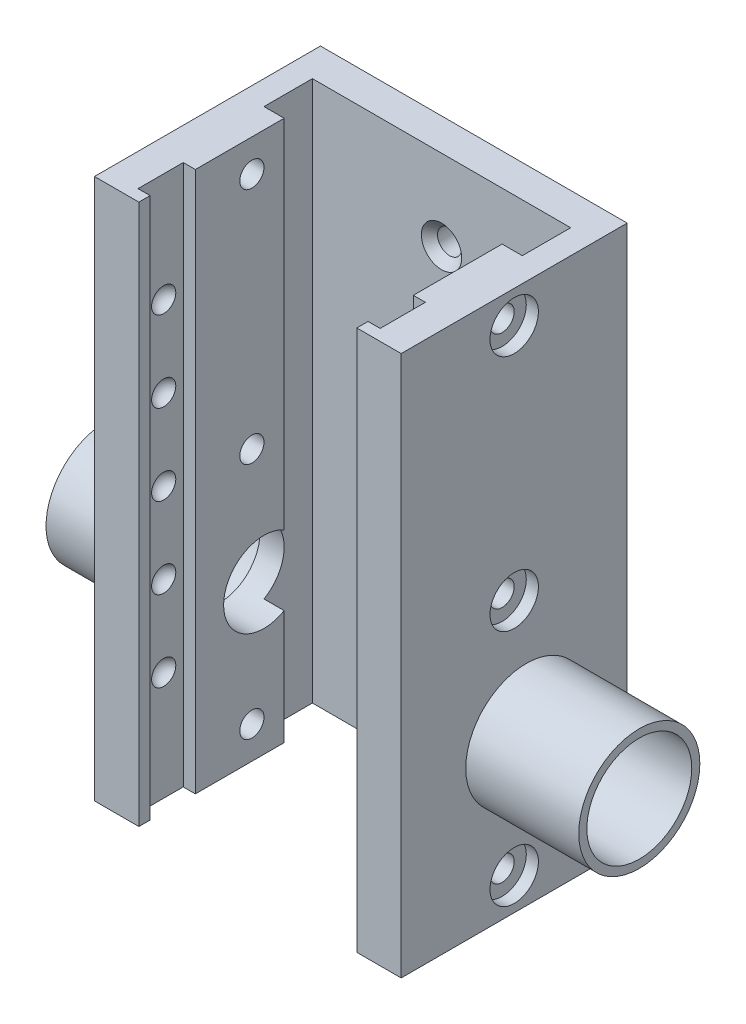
ISO-10303-21;
HEADER;
FILE_DESCRIPTION(('STEP AP214'),'2;1');
FILE_NAME('part.step','',(''),(''),'','','');
FILE_SCHEMA(('AUTOMOTIVE_DESIGN { 1 0 10303 214 1 1 1 1 }'));
ENDSEC;
DATA;
#1=APPLICATION_CONTEXT('core data for automotive mechanical design processes');
#2=APPLICATION_PROTOCOL_DEFINITION('international standard','automotive_design',2000,#1);
#3=PRODUCT_CONTEXT('',#1,'mechanical');
#4=PRODUCT('Part','Part','',(#3));
#5=PRODUCT_RELATED_PRODUCT_CATEGORY('part','',(#4));
#6=PRODUCT_DEFINITION_FORMATION('','',#4);
#7=PRODUCT_DEFINITION_CONTEXT('part definition',#1,'design');
#8=PRODUCT_DEFINITION('design','',#6,#7);
#9=PRODUCT_DEFINITION_SHAPE('','',#8);
#10=(LENGTH_UNIT() NAMED_UNIT(*) SI_UNIT(.MILLI.,.METRE.));
#11=(NAMED_UNIT(*) PLANE_ANGLE_UNIT() SI_UNIT($,.RADIAN.));
#12=(NAMED_UNIT(*) SI_UNIT($,.STERADIAN.) SOLID_ANGLE_UNIT());
#13=UNCERTAINTY_MEASURE_WITH_UNIT(LENGTH_MEASURE(1.E-05),#10,'distance_accuracy_value','');
#14=(GEOMETRIC_REPRESENTATION_CONTEXT(3) GLOBAL_UNCERTAINTY_ASSIGNED_CONTEXT((#13)) GLOBAL_UNIT_ASSIGNED_CONTEXT((#10,
#11,#12)) REPRESENTATION_CONTEXT('',''));
#15=CARTESIAN_POINT('',(0.,0.,0.));
#16=DIRECTION('',(0.,0.,1.));
#17=DIRECTION('',(1.,0.,0.));
#18=AXIS2_PLACEMENT_3D('',#15,#16,#17);
#19=CARTESIAN_POINT('',(34.,67.,-7.));
#20=DIRECTION('',(1.,0.,0.));
#21=DIRECTION('',(0.,0.,-1.));
#22=AXIS2_PLACEMENT_3D('',#19,#20,#21);
#23=PLANE('',#22);
#24=CARTESIAN_POINT('',(34.,43.5,-4.57362621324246));
#25=DIRECTION('',(1.,0.,0.));
#26=DIRECTION('',(0.,0.,-1.));
#27=AXIS2_PLACEMENT_3D('',#24,#25,#26);
#28=CIRCLE('',#27,1.5);
#29=CARTESIAN_POINT('',(34.,43.5,-6.07362621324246));
#30=VERTEX_POINT('',#29);
#31=EDGE_CURVE('E1131',#30,#30,#28,.T.);
#32=ORIENTED_EDGE('',*,*,#31,.T.);
#33=EDGE_LOOP('',(#32));
#34=FACE_BOUND('',#33,.T.);
#35=CARTESIAN_POINT('',(34.,23.5,-4.5736262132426));
#36=DIRECTION('',(1.,0.,0.));
#37=DIRECTION('',(0.,0.,-1.));
#38=AXIS2_PLACEMENT_3D('',#35,#36,#37);
#39=CIRCLE('',#38,1.5);
#40=CARTESIAN_POINT('',(34.,23.5,-6.0736262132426));
#41=VERTEX_POINT('',#40);
#42=EDGE_CURVE('E1125',#41,#41,#39,.T.);
#43=ORIENTED_EDGE('',*,*,#42,.T.);
#44=EDGE_LOOP('',(#43));
#45=FACE_BOUND('',#44,.T.);
#46=DIRECTION('',(0.,0.,1.));
#47=VECTOR('',#46,1.);
#48=CARTESIAN_POINT('',(34.,0.,-7.));
#49=LINE('',#48,#47);
#50=CARTESIAN_POINT('',(34.,0.,-7.));
#51=VERTEX_POINT('',#50);
#52=CARTESIAN_POINT('',(34.,0.,-1.39485090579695));
#53=VERTEX_POINT('',#52);
#54=EDGE_CURVE('E394',#51,#53,#49,.T.);
#55=ORIENTED_EDGE('',*,*,#54,.T.);
#56=DIRECTION('',(0.,-1.,0.));
#57=VECTOR('',#56,1.);
#58=CARTESIAN_POINT('',(34.,67.,-1.39485090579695));
#59=LINE('',#58,#57);
#60=CARTESIAN_POINT('',(34.,67.,-1.39485090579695));
#61=VERTEX_POINT('',#60);
#62=EDGE_CURVE('E465',#61,#53,#59,.T.);
#63=ORIENTED_EDGE('',*,*,#62,.F.);
#64=DIRECTION('',(0.,0.,1.));
#65=VECTOR('',#64,1.);
#66=CARTESIAN_POINT('',(34.,67.,-7.));
#67=LINE('',#66,#65);
#68=CARTESIAN_POINT('',(34.,67.,-7.));
#69=VERTEX_POINT('',#68);
#70=EDGE_CURVE('E433',#69,#61,#67,.T.);
#71=ORIENTED_EDGE('',*,*,#70,.F.);
#72=DIRECTION('',(0.,-1.,0.));
#73=VECTOR('',#72,1.);
#74=CARTESIAN_POINT('',(34.,67.,-7.));
#75=LINE('',#74,#73);
#76=EDGE_CURVE('E467',#69,#51,#75,.T.);
#77=ORIENTED_EDGE('',*,*,#76,.T.);
#78=EDGE_LOOP('',(#55,#63,#71,#77));
#79=FACE_BOUND('',#78,.T.);
#80=CARTESIAN_POINT('',(34.,13.5,-4.57362621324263));
#81=DIRECTION('',(1.,0.,0.));
#82=DIRECTION('',(0.,0.,-1.));
#83=AXIS2_PLACEMENT_3D('',#80,#81,#82);
#84=CIRCLE('',#83,1.5);
#85=CARTESIAN_POINT('',(34.,13.5,-6.07362621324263));
#86=VERTEX_POINT('',#85);
#87=EDGE_CURVE('E1122',#86,#86,#84,.T.);
#88=ORIENTED_EDGE('',*,*,#87,.T.);
#89=EDGE_LOOP('',(#88));
#90=FACE_BOUND('',#89,.T.);
#91=CARTESIAN_POINT('',(34.,53.5,-4.57362621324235));
#92=DIRECTION('',(1.,0.,0.));
#93=DIRECTION('',(0.,0.,-1.));
#94=AXIS2_PLACEMENT_3D('',#91,#92,#93);
#95=CIRCLE('',#94,1.5);
#96=CARTESIAN_POINT('',(34.,53.5,-6.07362621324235));
#97=VERTEX_POINT('',#96);
#98=EDGE_CURVE('E1128',#97,#97,#95,.T.);
#99=ORIENTED_EDGE('',*,*,#98,.T.);
#100=EDGE_LOOP('',(#99));
#101=FACE_BOUND('',#100,.T.);
#102=CARTESIAN_POINT('',(34.,33.5,-4.57362621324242));
#103=DIRECTION('',(1.,0.,0.));
#104=DIRECTION('',(0.,0.,-1.));
#105=AXIS2_PLACEMENT_3D('',#102,#103,#104);
#106=CIRCLE('',#105,1.5);
#107=CARTESIAN_POINT('',(34.,33.5,-6.07362621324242));
#108=VERTEX_POINT('',#107);
#109=EDGE_CURVE('E1133',#108,#108,#106,.T.);
#110=ORIENTED_EDGE('',*,*,#109,.T.);
#111=EDGE_LOOP('',(#110));
#112=FACE_BOUND('',#111,.T.);
#113=ADVANCED_FACE('F27',(#34,#45,#79,#90,#101,#112),#23,.F.);
#114=CARTESIAN_POINT('',(0.,67.,0.));
#115=DIRECTION('',(1.,0.,0.));
#116=DIRECTION('',(0.,0.,-1.));
#117=AXIS2_PLACEMENT_3D('',#114,#115,#116);
#118=PLANE('',#117);
#119=CARTESIAN_POINT('',(0.,18.5,-15.5));
#120=DIRECTION('',(1.,0.,0.));
#121=DIRECTION('',(0.,0.,-1.));
#122=AXIS2_PLACEMENT_3D('',#119,#120,#121);
#123=CIRCLE('',#122,5.);
#124=CARTESIAN_POINT('',(0.,18.5,-20.5));
#125=VERTEX_POINT('',#124);
#126=EDGE_CURVE('E193',#125,#125,#123,.T.);
#127=ORIENTED_EDGE('',*,*,#126,.T.);
#128=EDGE_LOOP('',(#127));
#129=FACE_BOUND('',#128,.T.);
#130=CARTESIAN_POINT('',(0.,18.5,-15.5));
#131=DIRECTION('',(1.,0.,0.));
#132=DIRECTION('',(0.,0.,-1.));
#133=AXIS2_PLACEMENT_3D('',#130,#131,#132);
#134=CIRCLE('',#133,6.5);
#135=CARTESIAN_POINT('',(0.,18.5,-22.));
#136=VERTEX_POINT('',#135);
#137=EDGE_CURVE('E248',#136,#136,#134,.T.);
#138=ORIENTED_EDGE('',*,*,#137,.F.);
#139=EDGE_LOOP('',(#138));
#140=FACE_BOUND('',#139,.T.);
#141=ADVANCED_FACE('F284',(#129,#140),#118,.F.);
#142=CARTESIAN_POINT('',(38.,67.,0.));
#143=DIRECTION('',(-1.,0.,0.));
#144=DIRECTION('',(0.,0.,1.));
#145=AXIS2_PLACEMENT_3D('',#142,#143,#144);
#146=PLANE('',#145);
#147=CARTESIAN_POINT('',(38.,4.,-14.));
#148=DIRECTION('',(1.,0.,0.));
#149=DIRECTION('',(0.,0.,-1.));
#150=AXIS2_PLACEMENT_3D('',#147,#148,#149);
#151=CIRCLE('',#150,3.);
#152=CARTESIAN_POINT('',(38.,4.,-17.));
#153=VERTEX_POINT('',#152);
#154=EDGE_CURVE('E560',#153,#153,#151,.T.);
#155=ORIENTED_EDGE('',*,*,#154,.F.);
#156=EDGE_LOOP('',(#155));
#157=FACE_BOUND('',#156,.T.);
#158=CARTESIAN_POINT('',(38.,63.,-14.));
#159=DIRECTION('',(1.,0.,0.));
#160=DIRECTION('',(0.,0.,-1.));
#161=AXIS2_PLACEMENT_3D('',#158,#159,#160);
#162=CIRCLE('',#161,3.);
#163=CARTESIAN_POINT('',(38.,63.,-17.));
#164=VERTEX_POINT('',#163);
#165=EDGE_CURVE('E566',#164,#164,#162,.T.);
#166=ORIENTED_EDGE('',*,*,#165,.F.);
#167=EDGE_LOOP('',(#166));
#168=FACE_BOUND('',#167,.T.);
#169=CARTESIAN_POINT('',(38.,33.5,-14.));
#170=DIRECTION('',(1.,0.,0.));
#171=DIRECTION('',(0.,0.,-1.));
#172=AXIS2_PLACEMENT_3D('',#169,#170,#171);
#173=CIRCLE('',#172,3.);
#174=CARTESIAN_POINT('',(38.,33.5,-17.));
#175=VERTEX_POINT('',#174);
#176=EDGE_CURVE('E572',#175,#175,#173,.T.);
#177=ORIENTED_EDGE('',*,*,#176,.F.);
#178=EDGE_LOOP('',(#177));
#179=FACE_BOUND('',#178,.T.);
#180=DIRECTION('',(0.,0.,-1.));
#181=VECTOR('',#180,1.);
#182=CARTESIAN_POINT('',(38.,0.,0.));
#183=LINE('',#182,#181);
#184=CARTESIAN_POINT('',(38.,0.,0.));
#185=VERTEX_POINT('',#184);
#186=CARTESIAN_POINT('',(38.,0.,-28.));
#187=VERTEX_POINT('',#186);
#188=EDGE_CURVE('E402',#185,#187,#183,.T.);
#189=ORIENTED_EDGE('',*,*,#188,.T.);
#190=DIRECTION('',(0.,-1.,0.));
#191=VECTOR('',#190,1.);
#192=CARTESIAN_POINT('',(38.,67.,-28.));
#193=LINE('',#192,#191);
#194=CARTESIAN_POINT('',(38.,67.,-28.));
#195=VERTEX_POINT('',#194);
#196=EDGE_CURVE('E453',#195,#187,#193,.T.);
#197=ORIENTED_EDGE('',*,*,#196,.F.);
#198=DIRECTION('',(0.,0.,-1.));
#199=VECTOR('',#198,1.);
#200=CARTESIAN_POINT('',(38.,67.,0.));
#201=LINE('',#200,#199);
#202=CARTESIAN_POINT('',(38.,67.,0.));
#203=VERTEX_POINT('',#202);
#204=EDGE_CURVE('E441',#203,#195,#201,.T.);
#205=ORIENTED_EDGE('',*,*,#204,.F.);
#206=DIRECTION('',(0.,-1.,0.));
#207=VECTOR('',#206,1.);
#208=CARTESIAN_POINT('',(38.,67.,0.));
#209=LINE('',#208,#207);
#210=EDGE_CURVE('E456',#203,#185,#209,.T.);
#211=ORIENTED_EDGE('',*,*,#210,.T.);
#212=EDGE_LOOP('',(#189,#197,#205,#211));
#213=FACE_BOUND('',#212,.T.);
#214=CARTESIAN_POINT('',(38.,18.5,-15.5));
#215=DIRECTION('',(-1.,0.,0.));
#216=DIRECTION('',(0.,0.,1.));
#217=AXIS2_PLACEMENT_3D('',#214,#215,#216);
#218=CIRCLE('',#217,7.5);
#219=CARTESIAN_POINT('',(38.,18.5,-8.));
#220=VERTEX_POINT('',#219);
#221=EDGE_CURVE('E245',#220,#220,#218,.F.);
#222=ORIENTED_EDGE('',*,*,#221,.F.);
#223=EDGE_LOOP('',(#222));
#224=FACE_BOUND('',#223,.T.);
#225=ADVANCED_FACE('F292',(#157,#168,#179,#213,#224),#146,.F.);
#226=CARTESIAN_POINT('',(3.,67.,-18.));
#227=DIRECTION('',(0.,0.,1.));
#228=DIRECTION('',(1.,0.,0.));
#229=AXIS2_PLACEMENT_3D('',#226,#227,#228);
#230=PLANE('',#229);
#231=DIRECTION('',(0.,-1.,0.));
#232=VECTOR('',#231,1.);
#233=CARTESIAN_POINT('',(3.,67.,-18.));
#234=LINE('',#233,#232);
#235=CARTESIAN_POINT('',(3.,14.1698729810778,-18.));
#236=VERTEX_POINT('',#235);
#237=CARTESIAN_POINT('',(3.,0.,-18.));
#238=VERTEX_POINT('',#237);
#239=EDGE_CURVE('E222',#236,#238,#234,.T.);
#240=ORIENTED_EDGE('',*,*,#239,.F.);
#241=DIRECTION('',(1.,0.,0.));
#242=VECTOR('',#241,1.);
#243=CARTESIAN_POINT('',(0.,14.1698729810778,-18.));
#244=LINE('',#243,#242);
#245=CARTESIAN_POINT('',(5.5,14.1698729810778,-18.));
#246=VERTEX_POINT('',#245);
#247=EDGE_CURVE('E42',#236,#246,#244,.T.);
#248=ORIENTED_EDGE('',*,*,#247,.T.);
#249=DIRECTION('',(0.,-1.,0.));
#250=VECTOR('',#249,1.);
#251=CARTESIAN_POINT('',(5.5,67.,-18.));
#252=LINE('',#251,#250);
#253=CARTESIAN_POINT('',(5.5,0.,-18.));
#254=VERTEX_POINT('',#253);
#255=EDGE_CURVE('E226',#246,#254,#252,.T.);
#256=ORIENTED_EDGE('',*,*,#255,.T.);
#257=DIRECTION('',(-1.,0.,0.));
#258=VECTOR('',#257,1.);
#259=CARTESIAN_POINT('',(3.,0.,-18.));
#260=LINE('',#259,#258);
#261=EDGE_CURVE('E377',#254,#238,#260,.T.);
#262=ORIENTED_EDGE('',*,*,#261,.T.);
#263=EDGE_LOOP('',(#240,#248,#256,#262));
#264=FACE_BOUND('',#263,.T.);
#265=ADVANCED_FACE('F329',(#264),#230,.F.);
#266=CARTESIAN_POINT('',(35.,67.,-18.));
#267=DIRECTION('',(0.,0.,1.));
#268=DIRECTION('',(1.,0.,0.));
#269=AXIS2_PLACEMENT_3D('',#266,#267,#268);
#270=PLANE('',#269);
#271=DIRECTION('',(0.,-1.,0.));
#272=VECTOR('',#271,1.);
#273=CARTESIAN_POINT('',(32.5,67.,-18.));
#274=LINE('',#273,#272);
#275=CARTESIAN_POINT('',(32.5,14.1698729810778,-18.));
#276=VERTEX_POINT('',#275);
#277=CARTESIAN_POINT('',(32.5,0.,-18.));
#278=VERTEX_POINT('',#277);
#279=EDGE_CURVE('E209',#276,#278,#274,.T.);
#280=ORIENTED_EDGE('',*,*,#279,.F.);
#281=DIRECTION('',(1.,0.,0.));
#282=VECTOR('',#281,1.);
#283=CARTESIAN_POINT('',(0.,14.1698729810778,-18.));
#284=LINE('',#283,#282);
#285=CARTESIAN_POINT('',(35.,14.1698729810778,-18.));
#286=VERTEX_POINT('',#285);
#287=EDGE_CURVE('E50',#276,#286,#284,.T.);
#288=ORIENTED_EDGE('',*,*,#287,.T.);
#289=DIRECTION('',(0.,-1.,0.));
#290=VECTOR('',#289,1.);
#291=CARTESIAN_POINT('',(35.,67.,-18.));
#292=LINE('',#291,#290);
#293=CARTESIAN_POINT('',(35.,0.,-18.));
#294=VERTEX_POINT('',#293);
#295=EDGE_CURVE('E208',#286,#294,#292,.T.);
#296=ORIENTED_EDGE('',*,*,#295,.T.);
#297=DIRECTION('',(-1.,0.,0.));
#298=VECTOR('',#297,1.);
#299=CARTESIAN_POINT('',(35.,0.,-18.));
#300=LINE('',#299,#298);
#301=EDGE_CURVE('E387',#294,#278,#300,.T.);
#302=ORIENTED_EDGE('',*,*,#301,.T.);
#303=EDGE_LOOP('',(#280,#288,#296,#302));
#304=FACE_BOUND('',#303,.T.);
#305=ADVANCED_FACE('F312',(#304),#270,.F.);
#306=CARTESIAN_POINT('',(0.,18.5,-15.5));
#307=DIRECTION('',(1.,0.,0.));
#308=DIRECTION('',(0.,0.,-1.));
#309=AXIS2_PLACEMENT_3D('',#306,#307,#308);
#310=CIRCLE('',#309,7.5);
#311=CARTESIAN_POINT('',(0.,18.5,-23.));
#312=VERTEX_POINT('',#311);
#313=EDGE_CURVE('E1101',#312,#312,#310,.T.);
#314=ORIENTED_EDGE('',*,*,#313,.T.);
#315=EDGE_LOOP('',(#314));
#316=FACE_BOUND('',#315,.T.);
#317=CARTESIAN_POINT('',(0.,63.,-14.));
#318=DIRECTION('',(1.,0.,0.));
#319=DIRECTION('',(0.,0.,-1.));
#320=AXIS2_PLACEMENT_3D('',#317,#318,#319);
#321=CIRCLE('',#320,3.);
#322=CARTESIAN_POINT('',(0.,63.,-17.));
#323=VERTEX_POINT('',#322);
#324=EDGE_CURVE('E548',#323,#323,#321,.T.);
#325=ORIENTED_EDGE('',*,*,#324,.T.);
#326=EDGE_LOOP('',(#325));
#327=FACE_BOUND('',#326,.T.);
#328=DIRECTION('',(0.,0.,1.));
#329=VECTOR('',#328,1.);
#330=CARTESIAN_POINT('',(0.,0.,0.));
#331=LINE('',#330,#329);
#332=CARTESIAN_POINT('',(0.,0.,-28.));
#333=VERTEX_POINT('',#332);
#334=CARTESIAN_POINT('',(0.,0.,0.));
#335=VERTEX_POINT('',#334);
#336=EDGE_CURVE('E406',#333,#335,#331,.T.);
#337=ORIENTED_EDGE('',*,*,#336,.T.);
#338=DIRECTION('',(0.,-1.,0.));
#339=VECTOR('',#338,1.);
#340=CARTESIAN_POINT('',(0.,67.,0.));
#341=LINE('',#340,#339);
#342=CARTESIAN_POINT('',(0.,67.,0.));
#343=VERTEX_POINT('',#342);
#344=EDGE_CURVE('E447',#343,#335,#341,.T.);
#345=ORIENTED_EDGE('',*,*,#344,.F.);
#346=DIRECTION('',(0.,0.,1.));
#347=VECTOR('',#346,1.);
#348=CARTESIAN_POINT('',(0.,67.,0.));
#349=LINE('',#348,#347);
#350=CARTESIAN_POINT('',(0.,67.,-28.));
#351=VERTEX_POINT('',#350);
#352=EDGE_CURVE('E445',#351,#343,#349,.T.);
#353=ORIENTED_EDGE('',*,*,#352,.F.);
#354=DIRECTION('',(0.,-1.,0.));
#355=VECTOR('',#354,1.);
#356=CARTESIAN_POINT('',(0.,67.,-28.));
#357=LINE('',#356,#355);
#358=EDGE_CURVE('E450',#351,#333,#357,.T.);
#359=ORIENTED_EDGE('',*,*,#358,.T.);
#360=EDGE_LOOP('',(#337,#345,#353,#359));
#361=FACE_BOUND('',#360,.T.);
#362=CARTESIAN_POINT('',(0.,33.5,-14.));
#363=DIRECTION('',(1.,0.,0.));
#364=DIRECTION('',(0.,0.,-1.));
#365=AXIS2_PLACEMENT_3D('',#362,#363,#364);
#366=CIRCLE('',#365,3.);
#367=CARTESIAN_POINT('',(0.,33.5,-17.));
#368=VERTEX_POINT('',#367);
#369=EDGE_CURVE('E554',#368,#368,#366,.T.);
#370=ORIENTED_EDGE('',*,*,#369,.T.);
#371=EDGE_LOOP('',(#370));
#372=FACE_BOUND('',#371,.T.);
#373=CARTESIAN_POINT('',(0.,4.,-14.));
#374=DIRECTION('',(1.,0.,0.));
#375=DIRECTION('',(0.,0.,-1.));
#376=AXIS2_PLACEMENT_3D('',#373,#374,#375);
#377=CIRCLE('',#376,3.);
#378=CARTESIAN_POINT('',(0.,4.,-17.));
#379=VERTEX_POINT('',#378);
#380=EDGE_CURVE('E542',#379,#379,#377,.T.);
#381=ORIENTED_EDGE('',*,*,#380,.T.);
#382=EDGE_LOOP('',(#381));
#383=FACE_BOUND('',#382,.T.);
#384=ADVANCED_FACE('F295',(#316,#327,#361,#372,#383),#118,.F.);
#385=CARTESIAN_POINT('',(5.5,67.,0.));
#386=DIRECTION('',(0.,0.,-1.));
#387=DIRECTION('',(-1.,0.,0.));
#388=AXIS2_PLACEMENT_3D('',#385,#386,#387);
#389=PLANE('',#388);
#390=DIRECTION('',(1.,0.,0.));
#391=VECTOR('',#390,1.);
#392=CARTESIAN_POINT('',(5.5,0.,0.));
#393=LINE('',#392,#391);
#394=CARTESIAN_POINT('',(5.5,0.,0.));
#395=VERTEX_POINT('',#394);
#396=EDGE_CURVE('E360',#335,#395,#393,.T.);
#397=ORIENTED_EDGE('',*,*,#396,.T.);
#398=DIRECTION('',(0.,-1.,0.));
#399=VECTOR('',#398,1.);
#400=CARTESIAN_POINT('',(5.5,67.,0.));
#401=LINE('',#400,#399);
#402=CARTESIAN_POINT('',(5.5,67.,0.));
#403=VERTEX_POINT('',#402);
#404=EDGE_CURVE('E242',#403,#395,#401,.T.);
#405=ORIENTED_EDGE('',*,*,#404,.F.);
#406=DIRECTION('',(1.,0.,0.));
#407=VECTOR('',#406,1.);
#408=CARTESIAN_POINT('',(5.5,67.,0.));
#409=LINE('',#408,#407);
#410=EDGE_CURVE('E408',#343,#403,#409,.T.);
#411=ORIENTED_EDGE('',*,*,#410,.F.);
#412=ORIENTED_EDGE('',*,*,#344,.T.);
#413=EDGE_LOOP('',(#397,#405,#411,#412));
#414=FACE_BOUND('',#413,.T.);
#415=ADVANCED_FACE('F29',(#414),#389,.F.);
#416=CARTESIAN_POINT('',(5.5,67.,-1.39485090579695));
#417=DIRECTION('',(-1.,0.,0.));
#418=DIRECTION('',(0.,0.,1.));
#419=AXIS2_PLACEMENT_3D('',#416,#417,#418);
#420=PLANE('',#419);
#421=DIRECTION('',(0.,0.,-1.));
#422=VECTOR('',#421,1.);
#423=CARTESIAN_POINT('',(5.5,0.,-1.39485090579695));
#424=LINE('',#423,#422);
#425=CARTESIAN_POINT('',(5.5,0.,-1.39485090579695));
#426=VERTEX_POINT('',#425);
#427=EDGE_CURVE('E352',#395,#426,#424,.T.);
#428=ORIENTED_EDGE('',*,*,#427,.T.);
#429=DIRECTION('',(0.,-1.,0.));
#430=VECTOR('',#429,1.);
#431=CARTESIAN_POINT('',(5.5,67.,-1.39485090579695));
#432=LINE('',#431,#430);
#433=CARTESIAN_POINT('',(5.5,67.,-1.39485090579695));
#434=VERTEX_POINT('',#433);
#435=EDGE_CURVE('E239',#434,#426,#432,.T.);
#436=ORIENTED_EDGE('',*,*,#435,.F.);
#437=DIRECTION('',(0.,0.,-1.));
#438=VECTOR('',#437,1.);
#439=CARTESIAN_POINT('',(5.5,67.,-1.39485090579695));
#440=LINE('',#439,#438);
#441=EDGE_CURVE('E411',#403,#434,#440,.T.);
#442=ORIENTED_EDGE('',*,*,#441,.F.);
#443=ORIENTED_EDGE('',*,*,#404,.T.);
#444=EDGE_LOOP('',(#428,#436,#442,#443));
#445=FACE_BOUND('',#444,.T.);
#446=ADVANCED_FACE('F343',(#445),#420,.F.);
#447=CARTESIAN_POINT('',(4.,67.,-1.39485090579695));
#448=DIRECTION('',(0.,0.,1.));
#449=DIRECTION('',(1.,0.,0.));
#450=AXIS2_PLACEMENT_3D('',#447,#448,#449);
#451=PLANE('',#450);
#452=DIRECTION('',(-1.,0.,0.));
#453=VECTOR('',#452,1.);
#454=CARTESIAN_POINT('',(4.,0.,-1.39485090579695));
#455=LINE('',#454,#453);
#456=CARTESIAN_POINT('',(4.,0.,-1.39485090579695));
#457=VERTEX_POINT('',#456);
#458=EDGE_CURVE('E359',#426,#457,#455,.T.);
#459=ORIENTED_EDGE('',*,*,#458,.T.);
#460=DIRECTION('',(0.,-1.,0.));
#461=VECTOR('',#460,1.);
#462=CARTESIAN_POINT('',(4.,67.,-1.39485090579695));
#463=LINE('',#462,#461);
#464=CARTESIAN_POINT('',(4.,67.,-1.39485090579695));
#465=VERTEX_POINT('',#464);
#466=EDGE_CURVE('E236',#465,#457,#463,.T.);
#467=ORIENTED_EDGE('',*,*,#466,.F.);
#468=DIRECTION('',(-1.,0.,0.));
#469=VECTOR('',#468,1.);
#470=CARTESIAN_POINT('',(4.,67.,-1.39485090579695));
#471=LINE('',#470,#469);
#472=EDGE_CURVE('E363',#434,#465,#471,.T.);
#473=ORIENTED_EDGE('',*,*,#472,.F.);
#474=ORIENTED_EDGE('',*,*,#435,.T.);
#475=EDGE_LOOP('',(#459,#467,#473,#474));
#476=FACE_BOUND('',#475,.T.);
#477=ADVANCED_FACE('F340',(#476),#451,.F.);
#478=CARTESIAN_POINT('',(4.,67.,-7.));
#479=DIRECTION('',(-1.,0.,0.));
#480=DIRECTION('',(0.,0.,1.));
#481=AXIS2_PLACEMENT_3D('',#478,#479,#480);
#482=PLANE('',#481);
#483=CARTESIAN_POINT('',(4.,33.5,-4.57362621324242));
#484=DIRECTION('',(1.,0.,0.));
#485=DIRECTION('',(0.,0.,-1.));
#486=AXIS2_PLACEMENT_3D('',#483,#484,#485);
#487=CIRCLE('',#486,1.5);
#488=CARTESIAN_POINT('',(4.,33.5,-6.07362621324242));
#489=VERTEX_POINT('',#488);
#490=EDGE_CURVE('E1119',#489,#489,#487,.T.);
#491=ORIENTED_EDGE('',*,*,#490,.F.);
#492=EDGE_LOOP('',(#491));
#493=FACE_BOUND('',#492,.T.);
#494=CARTESIAN_POINT('',(4.,43.5,-4.57362621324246));
#495=DIRECTION('',(1.,0.,0.));
#496=DIRECTION('',(0.,0.,-1.));
#497=AXIS2_PLACEMENT_3D('',#494,#495,#496);
#498=CIRCLE('',#497,1.5);
#499=CARTESIAN_POINT('',(4.,43.5,-6.07362621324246));
#500=VERTEX_POINT('',#499);
#501=EDGE_CURVE('E1116',#500,#500,#498,.T.);
#502=ORIENTED_EDGE('',*,*,#501,.F.);
#503=EDGE_LOOP('',(#502));
#504=FACE_BOUND('',#503,.T.);
#505=CARTESIAN_POINT('',(4.,53.5,-4.57362621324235));
#506=DIRECTION('',(1.,0.,0.));
#507=DIRECTION('',(0.,0.,-1.));
#508=AXIS2_PLACEMENT_3D('',#505,#506,#507);
#509=CIRCLE('',#508,1.5);
#510=CARTESIAN_POINT('',(4.,53.5,-6.07362621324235));
#511=VERTEX_POINT('',#510);
#512=EDGE_CURVE('E1113',#511,#511,#509,.T.);
#513=ORIENTED_EDGE('',*,*,#512,.F.);
#514=EDGE_LOOP('',(#513));
#515=FACE_BOUND('',#514,.T.);
#516=CARTESIAN_POINT('',(4.,23.5,-4.5736262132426));
#517=DIRECTION('',(1.,0.,0.));
#518=DIRECTION('',(0.,0.,-1.));
#519=AXIS2_PLACEMENT_3D('',#516,#517,#518);
#520=CIRCLE('',#519,1.5);
#521=CARTESIAN_POINT('',(4.,23.5,-6.0736262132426));
#522=VERTEX_POINT('',#521);
#523=EDGE_CURVE('E1110',#522,#522,#520,.T.);
#524=ORIENTED_EDGE('',*,*,#523,.F.);
#525=EDGE_LOOP('',(#524));
#526=FACE_BOUND('',#525,.T.);
#527=CARTESIAN_POINT('',(4.,13.5,-4.57362621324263));
#528=DIRECTION('',(1.,0.,0.));
#529=DIRECTION('',(0.,0.,-1.));
#530=AXIS2_PLACEMENT_3D('',#527,#528,#529);
#531=CIRCLE('',#530,1.5);
#532=CARTESIAN_POINT('',(4.,13.5,-6.07362621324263));
#533=VERTEX_POINT('',#532);
#534=EDGE_CURVE('E1107',#533,#533,#531,.T.);
#535=ORIENTED_EDGE('',*,*,#534,.F.);
#536=EDGE_LOOP('',(#535));
#537=FACE_BOUND('',#536,.T.);
#538=DIRECTION('',(0.,0.,-1.));
#539=VECTOR('',#538,1.);
#540=CARTESIAN_POINT('',(4.,0.,-7.));
#541=LINE('',#540,#539);
#542=CARTESIAN_POINT('',(4.,0.,-7.));
#543=VERTEX_POINT('',#542);
#544=EDGE_CURVE('E367',#457,#543,#541,.T.);
#545=ORIENTED_EDGE('',*,*,#544,.T.);
#546=DIRECTION('',(0.,-1.,0.));
#547=VECTOR('',#546,1.);
#548=CARTESIAN_POINT('',(4.,67.,-7.));
#549=LINE('',#548,#547);
#550=CARTESIAN_POINT('',(4.,67.,-7.));
#551=VERTEX_POINT('',#550);
#552=EDGE_CURVE('E233',#551,#543,#549,.T.);
#553=ORIENTED_EDGE('',*,*,#552,.F.);
#554=DIRECTION('',(0.,0.,-1.));
#555=VECTOR('',#554,1.);
#556=CARTESIAN_POINT('',(4.,67.,-7.));
#557=LINE('',#556,#555);
#558=EDGE_CURVE('E414',#465,#551,#557,.T.);
#559=ORIENTED_EDGE('',*,*,#558,.F.);
#560=ORIENTED_EDGE('',*,*,#466,.T.);
#561=EDGE_LOOP('',(#545,#553,#559,#560));
#562=FACE_BOUND('',#561,.T.);
#563=ADVANCED_FACE('F336',(#493,#504,#515,#526,#537,#562),#482,.F.);
#564=CARTESIAN_POINT('',(4.,67.,-7.));
#565=DIRECTION('',(0.,0.,-1.));
#566=DIRECTION('',(-1.,0.,0.));
#567=AXIS2_PLACEMENT_3D('',#564,#565,#566);
#568=PLANE('',#567);
#569=DIRECTION('',(1.,0.,0.));
#570=VECTOR('',#569,1.);
#571=CARTESIAN_POINT('',(4.,0.,-7.));
#572=LINE('',#571,#570);
#573=CARTESIAN_POINT('',(5.5,0.,-7.));
#574=VERTEX_POINT('',#573);
#575=EDGE_CURVE('E369',#543,#574,#572,.T.);
#576=ORIENTED_EDGE('',*,*,#575,.T.);
#577=DIRECTION('',(0.,-1.,0.));
#578=VECTOR('',#577,1.);
#579=CARTESIAN_POINT('',(5.5,67.,-7.));
#580=LINE('',#579,#578);
#581=CARTESIAN_POINT('',(5.5,67.,-7.));
#582=VERTEX_POINT('',#581);
#583=EDGE_CURVE('E230',#582,#574,#580,.T.);
#584=ORIENTED_EDGE('',*,*,#583,.F.);
#585=DIRECTION('',(1.,0.,0.));
#586=VECTOR('',#585,1.);
#587=CARTESIAN_POINT('',(4.,67.,-7.));
#588=LINE('',#587,#586);
#589=EDGE_CURVE('E416',#551,#582,#588,.T.);
#590=ORIENTED_EDGE('',*,*,#589,.F.);
#591=ORIENTED_EDGE('',*,*,#552,.T.);
#592=EDGE_LOOP('',(#576,#584,#590,#591));
#593=FACE_BOUND('',#592,.T.);
#594=ADVANCED_FACE('F332',(#593),#568,.F.);
#595=CARTESIAN_POINT('',(5.5,67.,-18.));
#596=DIRECTION('',(-1.,0.,0.));
#597=DIRECTION('',(0.,0.,1.));
#598=AXIS2_PLACEMENT_3D('',#595,#596,#597);
#599=PLANE('',#598);
#600=CARTESIAN_POINT('',(5.5,63.,-14.));
#601=DIRECTION('',(-1.,0.,0.));
#602=DIRECTION('',(0.,0.,1.));
#603=AXIS2_PLACEMENT_3D('',#600,#601,#602);
#604=CIRCLE('',#603,1.5);
#605=CARTESIAN_POINT('',(5.5,63.,-12.5));
#606=VERTEX_POINT('',#605);
#607=EDGE_CURVE('E515',#606,#606,#604,.T.);
#608=ORIENTED_EDGE('',*,*,#607,.T.);
#609=EDGE_LOOP('',(#608));
#610=FACE_BOUND('',#609,.T.);
#611=CARTESIAN_POINT('',(5.5,33.5,-14.));
#612=DIRECTION('',(-1.,0.,0.));
#613=DIRECTION('',(0.,0.,1.));
#614=AXIS2_PLACEMENT_3D('',#611,#612,#613);
#615=CIRCLE('',#614,1.5);
#616=CARTESIAN_POINT('',(5.5,33.5,-12.5));
#617=VERTEX_POINT('',#616);
#618=EDGE_CURVE('E527',#617,#617,#615,.T.);
#619=ORIENTED_EDGE('',*,*,#618,.T.);
#620=EDGE_LOOP('',(#619));
#621=FACE_BOUND('',#620,.T.);
#622=CARTESIAN_POINT('',(5.5,4.,-14.));
#623=DIRECTION('',(-1.,0.,0.));
#624=DIRECTION('',(0.,0.,1.));
#625=AXIS2_PLACEMENT_3D('',#622,#623,#624);
#626=CIRCLE('',#625,1.5);
#627=CARTESIAN_POINT('',(5.5,4.,-12.5));
#628=VERTEX_POINT('',#627);
#629=EDGE_CURVE('E539',#628,#628,#626,.T.);
#630=ORIENTED_EDGE('',*,*,#629,.T.);
#631=EDGE_LOOP('',(#630));
#632=FACE_BOUND('',#631,.T.);
#633=ORIENTED_EDGE('',*,*,#255,.F.);
#634=CARTESIAN_POINT('',(5.5,18.5,-15.5));
#635=DIRECTION('',(-1.,0.,0.));
#636=DIRECTION('',(0.,0.,1.));
#637=AXIS2_PLACEMENT_3D('',#634,#635,#636);
#638=CIRCLE('',#637,5.);
#639=CARTESIAN_POINT('',(5.5,22.8301270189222,-18.));
#640=VERTEX_POINT('',#639);
#641=EDGE_CURVE('E503',#246,#640,#638,.T.);
#642=ORIENTED_EDGE('',*,*,#641,.T.);
#643=CARTESIAN_POINT('',(5.5,67.,-18.));
#644=VERTEX_POINT('',#643);
#645=EDGE_CURVE('E227',#644,#640,#252,.T.);
#646=ORIENTED_EDGE('',*,*,#645,.F.);
#647=DIRECTION('',(0.,0.,-1.));
#648=VECTOR('',#647,1.);
#649=CARTESIAN_POINT('',(5.5,67.,-18.));
#650=LINE('',#649,#648);
#651=EDGE_CURVE('E418',#582,#644,#650,.T.);
#652=ORIENTED_EDGE('',*,*,#651,.F.);
#653=ORIENTED_EDGE('',*,*,#583,.T.);
#654=DIRECTION('',(0.,0.,-1.));
#655=VECTOR('',#654,1.);
#656=CARTESIAN_POINT('',(5.5,0.,-18.));
#657=LINE('',#656,#655);
#658=EDGE_CURVE('E374',#574,#254,#657,.T.);
#659=ORIENTED_EDGE('',*,*,#658,.T.);
#660=EDGE_LOOP('',(#633,#642,#646,#652,#653,#659));
#661=FACE_BOUND('',#660,.T.);
#662=ADVANCED_FACE('F327',(#610,#621,#632,#661),#599,.F.);
#663=ORIENTED_EDGE('',*,*,#645,.T.);
#664=DIRECTION('',(1.,0.,0.));
#665=VECTOR('',#664,1.);
#666=CARTESIAN_POINT('',(0.,22.8301270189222,-18.));
#667=LINE('',#666,#665);
#668=CARTESIAN_POINT('',(3.,22.8301270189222,-18.));
#669=VERTEX_POINT('',#668);
#670=EDGE_CURVE('E496',#640,#669,#667,.F.);
#671=ORIENTED_EDGE('',*,*,#670,.T.);
#672=CARTESIAN_POINT('',(3.,67.,-18.));
#673=VERTEX_POINT('',#672);
#674=EDGE_CURVE('E223',#673,#669,#234,.T.);
#675=ORIENTED_EDGE('',*,*,#674,.F.);
#676=DIRECTION('',(-1.,0.,0.));
#677=VECTOR('',#676,1.);
#678=CARTESIAN_POINT('',(3.,67.,-18.));
#679=LINE('',#678,#677);
#680=EDGE_CURVE('E420',#644,#673,#679,.T.);
#681=ORIENTED_EDGE('',*,*,#680,.F.);
#682=EDGE_LOOP('',(#663,#671,#675,#681));
#683=FACE_BOUND('',#682,.T.);
#684=ADVANCED_FACE('F323',(#683),#230,.F.);
#685=CARTESIAN_POINT('',(3.,67.,-24.));
#686=DIRECTION('',(-1.,0.,0.));
#687=DIRECTION('',(0.,0.,1.));
#688=AXIS2_PLACEMENT_3D('',#685,#686,#687);
#689=PLANE('',#688);
#690=ORIENTED_EDGE('',*,*,#674,.T.);
#691=CARTESIAN_POINT('',(3.,18.5,-15.5));
#692=DIRECTION('',(-1.,0.,0.));
#693=DIRECTION('',(0.,0.,1.));
#694=AXIS2_PLACEMENT_3D('',#691,#692,#693);
#695=CIRCLE('',#694,5.);
#696=EDGE_CURVE('E494',#669,#236,#695,.T.);
#697=ORIENTED_EDGE('',*,*,#696,.T.);
#698=ORIENTED_EDGE('',*,*,#239,.T.);
#699=DIRECTION('',(0.,0.,-1.));
#700=VECTOR('',#699,1.);
#701=CARTESIAN_POINT('',(3.,0.,-24.));
#702=LINE('',#701,#700);
#703=CARTESIAN_POINT('',(3.,0.,-24.));
#704=VERTEX_POINT('',#703);
#705=EDGE_CURVE('E380',#238,#704,#702,.T.);
#706=ORIENTED_EDGE('',*,*,#705,.T.);
#707=DIRECTION('',(0.,-1.,0.));
#708=VECTOR('',#707,1.);
#709=CARTESIAN_POINT('',(3.,67.,-24.));
#710=LINE('',#709,#708);
#711=CARTESIAN_POINT('',(3.,67.,-24.));
#712=VERTEX_POINT('',#711);
#713=EDGE_CURVE('E219',#712,#704,#710,.T.);
#714=ORIENTED_EDGE('',*,*,#713,.F.);
#715=DIRECTION('',(0.,0.,-1.));
#716=VECTOR('',#715,1.);
#717=CARTESIAN_POINT('',(3.,67.,-24.));
#718=LINE('',#717,#716);
#719=EDGE_CURVE('E422',#673,#712,#718,.T.);
#720=ORIENTED_EDGE('',*,*,#719,.F.);
#721=EDGE_LOOP('',(#690,#697,#698,#706,#714,#720));
#722=FACE_BOUND('',#721,.T.);
#723=ADVANCED_FACE('F319',(#722),#689,.F.);
#724=CARTESIAN_POINT('',(35.,67.,-24.));
#725=DIRECTION('',(0.,0.,-1.));
#726=DIRECTION('',(-1.,0.,0.));
#727=AXIS2_PLACEMENT_3D('',#724,#725,#726);
#728=PLANE('',#727);
#729=CARTESIAN_POINT('',(19.,57.,-24.));
#730=DIRECTION('',(0.,0.,-1.));
#731=DIRECTION('',(-1.,0.,0.));
#732=AXIS2_PLACEMENT_3D('',#729,#730,#731);
#733=CIRCLE('',#732,2.5);
#734=CARTESIAN_POINT('',(16.5,57.,-24.));
#735=VERTEX_POINT('',#734);
#736=EDGE_CURVE('E260',#735,#735,#733,.T.);
#737=ORIENTED_EDGE('',*,*,#736,.T.);
#738=EDGE_LOOP('',(#737));
#739=FACE_BOUND('',#738,.T.);
#740=CARTESIAN_POINT('',(19.,33.5,-24.));
#741=DIRECTION('',(0.,0.,-1.));
#742=DIRECTION('',(-1.,0.,0.));
#743=AXIS2_PLACEMENT_3D('',#740,#741,#742);
#744=CIRCLE('',#743,2.5);
#745=CARTESIAN_POINT('',(16.5,33.5,-24.));
#746=VERTEX_POINT('',#745);
#747=EDGE_CURVE('E257',#746,#746,#744,.T.);
#748=ORIENTED_EDGE('',*,*,#747,.T.);
#749=EDGE_LOOP('',(#748));
#750=FACE_BOUND('',#749,.T.);
#751=CARTESIAN_POINT('',(19.,10.,-24.));
#752=DIRECTION('',(0.,0.,-1.));
#753=DIRECTION('',(-1.,0.,0.));
#754=AXIS2_PLACEMENT_3D('',#751,#752,#753);
#755=CIRCLE('',#754,2.5);
#756=CARTESIAN_POINT('',(16.5,10.,-24.));
#757=VERTEX_POINT('',#756);
#758=EDGE_CURVE('E254',#757,#757,#755,.T.);
#759=ORIENTED_EDGE('',*,*,#758,.T.);
#760=EDGE_LOOP('',(#759));
#761=FACE_BOUND('',#760,.T.);
#762=DIRECTION('',(1.,0.,0.));
#763=VECTOR('',#762,1.);
#764=CARTESIAN_POINT('',(35.,0.,-24.));
#765=LINE('',#764,#763);
#766=CARTESIAN_POINT('',(35.,0.,-24.));
#767=VERTEX_POINT('',#766);
#768=EDGE_CURVE('E382',#704,#767,#765,.T.);
#769=ORIENTED_EDGE('',*,*,#768,.T.);
#770=DIRECTION('',(0.,-1.,0.));
#771=VECTOR('',#770,1.);
#772=CARTESIAN_POINT('',(35.,67.,-24.));
#773=LINE('',#772,#771);
#774=CARTESIAN_POINT('',(35.,67.,-24.));
#775=VERTEX_POINT('',#774);
#776=EDGE_CURVE('E216',#775,#767,#773,.T.);
#777=ORIENTED_EDGE('',*,*,#776,.F.);
#778=DIRECTION('',(1.,0.,0.));
#779=VECTOR('',#778,1.);
#780=CARTESIAN_POINT('',(35.,67.,-24.));
#781=LINE('',#780,#779);
#782=EDGE_CURVE('E424',#712,#775,#781,.T.);
#783=ORIENTED_EDGE('',*,*,#782,.F.);
#784=ORIENTED_EDGE('',*,*,#713,.T.);
#785=EDGE_LOOP('',(#769,#777,#783,#784));
#786=FACE_BOUND('',#785,.T.);
#787=ADVANCED_FACE('F315',(#739,#750,#761,#786),#728,.F.);
#788=CARTESIAN_POINT('',(35.,67.,-24.));
#789=DIRECTION('',(1.,0.,0.));
#790=DIRECTION('',(0.,0.,-1.));
#791=AXIS2_PLACEMENT_3D('',#788,#789,#790);
#792=PLANE('',#791);
#793=ORIENTED_EDGE('',*,*,#295,.F.);
#794=CARTESIAN_POINT('',(35.,18.5,-15.5));
#795=DIRECTION('',(1.,0.,0.));
#796=DIRECTION('',(0.,0.,-1.));
#797=AXIS2_PLACEMENT_3D('',#794,#795,#796);
#798=CIRCLE('',#797,5.);
#799=CARTESIAN_POINT('',(35.,22.8301270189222,-18.));
#800=VERTEX_POINT('',#799);
#801=EDGE_CURVE('E493',#286,#800,#798,.T.);
#802=ORIENTED_EDGE('',*,*,#801,.T.);
#803=CARTESIAN_POINT('',(35.,67.,-18.));
#804=VERTEX_POINT('',#803);
#805=EDGE_CURVE('E203',#804,#800,#292,.T.);
#806=ORIENTED_EDGE('',*,*,#805,.F.);
#807=DIRECTION('',(0.,0.,1.));
#808=VECTOR('',#807,1.);
#809=CARTESIAN_POINT('',(35.,67.,-24.));
#810=LINE('',#809,#808);
#811=EDGE_CURVE('E426',#775,#804,#810,.T.);
#812=ORIENTED_EDGE('',*,*,#811,.F.);
#813=ORIENTED_EDGE('',*,*,#776,.T.);
#814=DIRECTION('',(0.,0.,1.));
#815=VECTOR('',#814,1.);
#816=CARTESIAN_POINT('',(35.,0.,-24.));
#817=LINE('',#816,#815);
#818=EDGE_CURVE('E384',#767,#294,#817,.T.);
#819=ORIENTED_EDGE('',*,*,#818,.T.);
#820=EDGE_LOOP('',(#793,#802,#806,#812,#813,#819));
#821=FACE_BOUND('',#820,.T.);
#822=ADVANCED_FACE('F311',(#821),#792,.F.);
#823=ORIENTED_EDGE('',*,*,#805,.T.);
#824=DIRECTION('',(1.,0.,0.));
#825=VECTOR('',#824,1.);
#826=CARTESIAN_POINT('',(0.,22.8301270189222,-18.));
#827=LINE('',#826,#825);
#828=CARTESIAN_POINT('',(32.5,22.8301270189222,-18.));
#829=VERTEX_POINT('',#828);
#830=EDGE_CURVE('E188',#800,#829,#827,.F.);
#831=ORIENTED_EDGE('',*,*,#830,.T.);
#832=CARTESIAN_POINT('',(32.5,67.,-18.));
#833=VERTEX_POINT('',#832);
#834=EDGE_CURVE('E200',#833,#829,#274,.T.);
#835=ORIENTED_EDGE('',*,*,#834,.F.);
#836=DIRECTION('',(-1.,0.,0.));
#837=VECTOR('',#836,1.);
#838=CARTESIAN_POINT('',(35.,67.,-18.));
#839=LINE('',#838,#837);
#840=EDGE_CURVE('E428',#804,#833,#839,.T.);
#841=ORIENTED_EDGE('',*,*,#840,.F.);
#842=EDGE_LOOP('',(#823,#831,#835,#841));
#843=FACE_BOUND('',#842,.T.);
#844=ADVANCED_FACE('F198',(#843),#270,.F.);
#845=CARTESIAN_POINT('',(32.5,67.,-18.));
#846=DIRECTION('',(1.,0.,0.));
#847=DIRECTION('',(0.,0.,-1.));
#848=AXIS2_PLACEMENT_3D('',#845,#846,#847);
#849=PLANE('',#848);
#850=CARTESIAN_POINT('',(32.5,63.,-14.));
#851=DIRECTION('',(1.,0.,0.));
#852=DIRECTION('',(0.,0.,-1.));
#853=AXIS2_PLACEMENT_3D('',#850,#851,#852);
#854=CIRCLE('',#853,1.5);
#855=CARTESIAN_POINT('',(32.5,63.,-15.5));
#856=VERTEX_POINT('',#855);
#857=EDGE_CURVE('E512',#856,#856,#854,.T.);
#858=ORIENTED_EDGE('',*,*,#857,.T.);
#859=EDGE_LOOP('',(#858));
#860=FACE_BOUND('',#859,.T.);
#861=CARTESIAN_POINT('',(32.5,33.5,-14.));
#862=DIRECTION('',(1.,0.,0.));
#863=DIRECTION('',(0.,0.,-1.));
#864=AXIS2_PLACEMENT_3D('',#861,#862,#863);
#865=CIRCLE('',#864,1.5);
#866=CARTESIAN_POINT('',(32.5,33.5,-15.5));
#867=VERTEX_POINT('',#866);
#868=EDGE_CURVE('E524',#867,#867,#865,.T.);
#869=ORIENTED_EDGE('',*,*,#868,.T.);
#870=EDGE_LOOP('',(#869));
#871=FACE_BOUND('',#870,.T.);
#872=CARTESIAN_POINT('',(32.5,4.,-14.));
#873=DIRECTION('',(1.,0.,0.));
#874=DIRECTION('',(0.,0.,-1.));
#875=AXIS2_PLACEMENT_3D('',#872,#873,#874);
#876=CIRCLE('',#875,1.5);
#877=CARTESIAN_POINT('',(32.5,4.,-15.5));
#878=VERTEX_POINT('',#877);
#879=EDGE_CURVE('E536',#878,#878,#876,.T.);
#880=ORIENTED_EDGE('',*,*,#879,.T.);
#881=EDGE_LOOP('',(#880));
#882=FACE_BOUND('',#881,.T.);
#883=ORIENTED_EDGE('',*,*,#834,.T.);
#884=CARTESIAN_POINT('',(32.5,18.5,-15.5));
#885=DIRECTION('',(1.,0.,0.));
#886=DIRECTION('',(0.,0.,-1.));
#887=AXIS2_PLACEMENT_3D('',#884,#885,#886);
#888=CIRCLE('',#887,5.);
#889=EDGE_CURVE('E185',#829,#276,#888,.T.);
#890=ORIENTED_EDGE('',*,*,#889,.T.);
#891=ORIENTED_EDGE('',*,*,#279,.T.);
#892=DIRECTION('',(0.,0.,1.));
#893=VECTOR('',#892,1.);
#894=CARTESIAN_POINT('',(32.5,0.,-18.));
#895=LINE('',#894,#893);
#896=CARTESIAN_POINT('',(32.5,0.,-7.));
#897=VERTEX_POINT('',#896);
#898=EDGE_CURVE('E390',#278,#897,#895,.T.);
#899=ORIENTED_EDGE('',*,*,#898,.T.);
#900=DIRECTION('',(0.,-1.,0.));
#901=VECTOR('',#900,1.);
#902=CARTESIAN_POINT('',(32.5,67.,-7.));
#903=LINE('',#902,#901);
#904=CARTESIAN_POINT('',(32.5,67.,-7.));
#905=VERTEX_POINT('',#904);
#906=EDGE_CURVE('E212',#905,#897,#903,.T.);
#907=ORIENTED_EDGE('',*,*,#906,.F.);
#908=DIRECTION('',(0.,0.,1.));
#909=VECTOR('',#908,1.);
#910=CARTESIAN_POINT('',(32.5,67.,-18.));
#911=LINE('',#910,#909);
#912=EDGE_CURVE('E207',#833,#905,#911,.T.);
#913=ORIENTED_EDGE('',*,*,#912,.F.);
#914=EDGE_LOOP('',(#883,#890,#891,#899,#907,#913));
#915=FACE_BOUND('',#914,.T.);
#916=ADVANCED_FACE('F205',(#860,#871,#882,#915),#849,.F.);
#917=CARTESIAN_POINT('',(34.,67.,-7.));
#918=DIRECTION('',(0.,0.,-1.));
#919=DIRECTION('',(-1.,0.,0.));
#920=AXIS2_PLACEMENT_3D('',#917,#918,#919);
#921=PLANE('',#920);
#922=DIRECTION('',(1.,0.,0.));
#923=VECTOR('',#922,1.);
#924=CARTESIAN_POINT('',(34.,0.,-7.));
#925=LINE('',#924,#923);
#926=EDGE_CURVE('E392',#897,#51,#925,.T.);
#927=ORIENTED_EDGE('',*,*,#926,.T.);
#928=ORIENTED_EDGE('',*,*,#76,.F.);
#929=DIRECTION('',(1.,0.,0.));
#930=VECTOR('',#929,1.);
#931=CARTESIAN_POINT('',(34.,67.,-7.));
#932=LINE('',#931,#930);
#933=EDGE_CURVE('E431',#905,#69,#932,.T.);
#934=ORIENTED_EDGE('',*,*,#933,.F.);
#935=ORIENTED_EDGE('',*,*,#906,.T.);
#936=EDGE_LOOP('',(#927,#928,#934,#935));
#937=FACE_BOUND('',#936,.T.);
#938=ADVANCED_FACE('F302',(#937),#921,.F.);
#939=CARTESIAN_POINT('',(34.,67.,-1.39485090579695));
#940=DIRECTION('',(0.,0.,1.));
#941=DIRECTION('',(1.,0.,0.));
#942=AXIS2_PLACEMENT_3D('',#939,#940,#941);
#943=PLANE('',#942);
#944=DIRECTION('',(-1.,0.,0.));
#945=VECTOR('',#944,1.);
#946=CARTESIAN_POINT('',(34.,0.,-1.39485090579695));
#947=LINE('',#946,#945);
#948=CARTESIAN_POINT('',(32.5,0.,-1.39485090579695));
#949=VERTEX_POINT('',#948);
#950=EDGE_CURVE('E396',#53,#949,#947,.T.);
#951=ORIENTED_EDGE('',*,*,#950,.T.);
#952=DIRECTION('',(0.,-1.,0.));
#953=VECTOR('',#952,1.);
#954=CARTESIAN_POINT('',(32.5,67.,-1.39485090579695));
#955=LINE('',#954,#953);
#956=CARTESIAN_POINT('',(32.5,67.,-1.39485090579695));
#957=VERTEX_POINT('',#956);
#958=EDGE_CURVE('E462',#957,#949,#955,.T.);
#959=ORIENTED_EDGE('',*,*,#958,.F.);
#960=DIRECTION('',(-1.,0.,0.));
#961=VECTOR('',#960,1.);
#962=CARTESIAN_POINT('',(34.,67.,-1.39485090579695));
#963=LINE('',#962,#961);
#964=EDGE_CURVE('E435',#61,#957,#963,.T.);
#965=ORIENTED_EDGE('',*,*,#964,.F.);
#966=ORIENTED_EDGE('',*,*,#62,.T.);
#967=EDGE_LOOP('',(#951,#959,#965,#966));
#968=FACE_BOUND('',#967,.T.);
#969=ADVANCED_FACE('F300',(#968),#943,.F.);
#970=CARTESIAN_POINT('',(32.5,67.,-1.39485090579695));
#971=DIRECTION('',(1.,0.,0.));
#972=DIRECTION('',(0.,0.,-1.));
#973=AXIS2_PLACEMENT_3D('',#970,#971,#972);
#974=PLANE('',#973);
#975=DIRECTION('',(0.,0.,1.));
#976=VECTOR('',#975,1.);
#977=CARTESIAN_POINT('',(32.5,0.,-1.39485090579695));
#978=LINE('',#977,#976);
#979=CARTESIAN_POINT('',(32.5,0.,0.));
#980=VERTEX_POINT('',#979);
#981=EDGE_CURVE('E398',#949,#980,#978,.T.);
#982=ORIENTED_EDGE('',*,*,#981,.T.);
#983=DIRECTION('',(0.,-1.,0.));
#984=VECTOR('',#983,1.);
#985=CARTESIAN_POINT('',(32.5,67.,0.));
#986=LINE('',#985,#984);
#987=CARTESIAN_POINT('',(32.5,67.,0.));
#988=VERTEX_POINT('',#987);
#989=EDGE_CURVE('E459',#988,#980,#986,.T.);
#990=ORIENTED_EDGE('',*,*,#989,.F.);
#991=DIRECTION('',(0.,0.,1.));
#992=VECTOR('',#991,1.);
#993=CARTESIAN_POINT('',(32.5,67.,-1.39485090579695));
#994=LINE('',#993,#992);
#995=EDGE_CURVE('E437',#957,#988,#994,.T.);
#996=ORIENTED_EDGE('',*,*,#995,.F.);
#997=ORIENTED_EDGE('',*,*,#958,.T.);
#998=EDGE_LOOP('',(#982,#990,#996,#997));
#999=FACE_BOUND('',#998,.T.);
#1000=ADVANCED_FACE('F599',(#999),#974,.F.);
#1001=CARTESIAN_POINT('',(38.,67.,0.));
#1002=DIRECTION('',(0.,0.,-1.));
#1003=DIRECTION('',(-1.,0.,0.));
#1004=AXIS2_PLACEMENT_3D('',#1001,#1002,#1003);
#1005=PLANE('',#1004);
#1006=DIRECTION('',(1.,0.,0.));
#1007=VECTOR('',#1006,1.);
#1008=CARTESIAN_POINT('',(38.,0.,0.));
#1009=LINE('',#1008,#1007);
#1010=EDGE_CURVE('E400',#980,#185,#1009,.T.);
#1011=ORIENTED_EDGE('',*,*,#1010,.T.);
#1012=ORIENTED_EDGE('',*,*,#210,.F.);
#1013=DIRECTION('',(1.,0.,0.));
#1014=VECTOR('',#1013,1.);
#1015=CARTESIAN_POINT('',(38.,67.,0.));
#1016=LINE('',#1015,#1014);
#1017=EDGE_CURVE('E439',#988,#203,#1016,.T.);
#1018=ORIENTED_EDGE('',*,*,#1017,.F.);
#1019=ORIENTED_EDGE('',*,*,#989,.T.);
#1020=EDGE_LOOP('',(#1011,#1012,#1018,#1019));
#1021=FACE_BOUND('',#1020,.T.);
#1022=ADVANCED_FACE('F596',(#1021),#1005,.F.);
#1023=CARTESIAN_POINT('',(38.,18.5,-15.5));
#1024=DIRECTION('',(1.,0.,0.));
#1025=DIRECTION('',(0.,0.,-1.));
#1026=AXIS2_PLACEMENT_3D('',#1023,#1024,#1025);
#1027=CIRCLE('',#1026,6.5);
#1028=CARTESIAN_POINT('',(38.,18.5,-22.));
#1029=VERTEX_POINT('',#1028);
#1030=EDGE_CURVE('E1095',#1029,#1029,#1027,.T.);
#1031=ORIENTED_EDGE('',*,*,#1030,.T.);
#1032=EDGE_LOOP('',(#1031));
#1033=FACE_BOUND('',#1032,.T.);
#1034=CARTESIAN_POINT('',(38.,18.5,-15.5));
#1035=DIRECTION('',(1.,0.,0.));
#1036=DIRECTION('',(0.,0.,-1.));
#1037=AXIS2_PLACEMENT_3D('',#1034,#1035,#1036);
#1038=CIRCLE('',#1037,5.);
#1039=CARTESIAN_POINT('',(38.,18.5,-20.5));
#1040=VERTEX_POINT('',#1039);
#1041=EDGE_CURVE('E1083',#1040,#1040,#1038,.T.);
#1042=ORIENTED_EDGE('',*,*,#1041,.F.);
#1043=EDGE_LOOP('',(#1042));
#1044=FACE_BOUND('',#1043,.T.);
#1045=ADVANCED_FACE('F605',(#1033,#1044),#146,.F.);
#1046=CARTESIAN_POINT('',(0.,67.,-28.));
#1047=DIRECTION('',(0.,0.,1.));
#1048=DIRECTION('',(1.,0.,0.));
#1049=AXIS2_PLACEMENT_3D('',#1046,#1047,#1048);
#1050=PLANE('',#1049);
#1051=CARTESIAN_POINT('',(19.,33.5,-28.));
#1052=DIRECTION('',(0.,0.,1.));
#1053=DIRECTION('',(1.,0.,0.));
#1054=AXIS2_PLACEMENT_3D('',#1051,#1052,#1053);
#1055=CIRCLE('',#1054,1.5);
#1056=CARTESIAN_POINT('',(20.5,33.5,-28.));
#1057=VERTEX_POINT('',#1056);
#1058=EDGE_CURVE('E1142',#1057,#1057,#1055,.T.);
#1059=ORIENTED_EDGE('',*,*,#1058,.T.);
#1060=EDGE_LOOP('',(#1059));
#1061=FACE_BOUND('',#1060,.T.);
#1062=CARTESIAN_POINT('',(19.,10.,-28.));
#1063=DIRECTION('',(0.,0.,1.));
#1064=DIRECTION('',(1.,0.,0.));
#1065=AXIS2_PLACEMENT_3D('',#1062,#1063,#1064);
#1066=CIRCLE('',#1065,1.5);
#1067=CARTESIAN_POINT('',(20.5,10.,-28.));
#1068=VERTEX_POINT('',#1067);
#1069=EDGE_CURVE('E1139',#1068,#1068,#1066,.T.);
#1070=ORIENTED_EDGE('',*,*,#1069,.T.);
#1071=EDGE_LOOP('',(#1070));
#1072=FACE_BOUND('',#1071,.T.);
#1073=CARTESIAN_POINT('',(19.,57.,-28.));
#1074=DIRECTION('',(0.,0.,1.));
#1075=DIRECTION('',(1.,0.,0.));
#1076=AXIS2_PLACEMENT_3D('',#1073,#1074,#1075);
#1077=CIRCLE('',#1076,1.5);
#1078=CARTESIAN_POINT('',(20.5,57.,-28.));
#1079=VERTEX_POINT('',#1078);
#1080=EDGE_CURVE('E1136',#1079,#1079,#1077,.T.);
#1081=ORIENTED_EDGE('',*,*,#1080,.T.);
#1082=EDGE_LOOP('',(#1081));
#1083=FACE_BOUND('',#1082,.T.);
#1084=DIRECTION('',(-1.,0.,0.));
#1085=VECTOR('',#1084,1.);
#1086=CARTESIAN_POINT('',(0.,0.,-28.));
#1087=LINE('',#1086,#1085);
#1088=EDGE_CURVE('E404',#187,#333,#1087,.T.);
#1089=ORIENTED_EDGE('',*,*,#1088,.T.);
#1090=ORIENTED_EDGE('',*,*,#358,.F.);
#1091=DIRECTION('',(-1.,0.,0.));
#1092=VECTOR('',#1091,1.);
#1093=CARTESIAN_POINT('',(0.,67.,-28.));
#1094=LINE('',#1093,#1092);
#1095=EDGE_CURVE('E443',#195,#351,#1094,.T.);
#1096=ORIENTED_EDGE('',*,*,#1095,.F.);
#1097=ORIENTED_EDGE('',*,*,#196,.T.);
#1098=EDGE_LOOP('',(#1089,#1090,#1096,#1097));
#1099=FACE_BOUND('',#1098,.T.);
#1100=ADVANCED_FACE('F588',(#1061,#1072,#1083,#1099),#1050,.F.);
#1101=CARTESIAN_POINT('',(0.,67.,0.));
#1102=DIRECTION('',(0.,-1.,0.));
#1103=DIRECTION('',(0.,0.,-1.));
#1104=AXIS2_PLACEMENT_3D('',#1101,#1102,#1103);
#1105=PLANE('',#1104);
#1106=ORIENTED_EDGE('',*,*,#410,.T.);
#1107=ORIENTED_EDGE('',*,*,#441,.T.);
#1108=ORIENTED_EDGE('',*,*,#472,.T.);
#1109=ORIENTED_EDGE('',*,*,#558,.T.);
#1110=ORIENTED_EDGE('',*,*,#589,.T.);
#1111=ORIENTED_EDGE('',*,*,#651,.T.);
#1112=ORIENTED_EDGE('',*,*,#680,.T.);
#1113=ORIENTED_EDGE('',*,*,#719,.T.);
#1114=ORIENTED_EDGE('',*,*,#782,.T.);
#1115=ORIENTED_EDGE('',*,*,#811,.T.);
#1116=ORIENTED_EDGE('',*,*,#840,.T.);
#1117=ORIENTED_EDGE('',*,*,#912,.T.);
#1118=ORIENTED_EDGE('',*,*,#933,.T.);
#1119=ORIENTED_EDGE('',*,*,#70,.T.);
#1120=ORIENTED_EDGE('',*,*,#964,.T.);
#1121=ORIENTED_EDGE('',*,*,#995,.T.);
#1122=ORIENTED_EDGE('',*,*,#1017,.T.);
#1123=ORIENTED_EDGE('',*,*,#204,.T.);
#1124=ORIENTED_EDGE('',*,*,#1095,.T.);
#1125=ORIENTED_EDGE('',*,*,#352,.T.);
#1126=EDGE_LOOP('',(#1106,#1107,#1108,#1109,#1110,#1111,#1112,#1113,#1114,#1115,#1116,#1117,
#1118,#1119,#1120,#1121,#1122,#1123,#1124,#1125));
#1127=FACE_BOUND('',#1126,.T.);
#1128=ADVANCED_FACE('F487',(#1127),#1105,.F.);
#1129=CARTESIAN_POINT('',(0.,0.,0.));
#1130=DIRECTION('',(0.,-1.,0.));
#1131=DIRECTION('',(0.,0.,-1.));
#1132=AXIS2_PLACEMENT_3D('',#1129,#1130,#1131);
#1133=PLANE('',#1132);
#1134=ORIENTED_EDGE('',*,*,#396,.F.);
#1135=ORIENTED_EDGE('',*,*,#336,.F.);
#1136=ORIENTED_EDGE('',*,*,#1088,.F.);
#1137=ORIENTED_EDGE('',*,*,#188,.F.);
#1138=ORIENTED_EDGE('',*,*,#1010,.F.);
#1139=ORIENTED_EDGE('',*,*,#981,.F.);
#1140=ORIENTED_EDGE('',*,*,#950,.F.);
#1141=ORIENTED_EDGE('',*,*,#54,.F.);
#1142=ORIENTED_EDGE('',*,*,#926,.F.);
#1143=ORIENTED_EDGE('',*,*,#898,.F.);
#1144=ORIENTED_EDGE('',*,*,#301,.F.);
#1145=ORIENTED_EDGE('',*,*,#818,.F.);
#1146=ORIENTED_EDGE('',*,*,#768,.F.);
#1147=ORIENTED_EDGE('',*,*,#705,.F.);
#1148=ORIENTED_EDGE('',*,*,#261,.F.);
#1149=ORIENTED_EDGE('',*,*,#658,.F.);
#1150=ORIENTED_EDGE('',*,*,#575,.F.);
#1151=ORIENTED_EDGE('',*,*,#544,.F.);
#1152=ORIENTED_EDGE('',*,*,#458,.F.);
#1153=ORIENTED_EDGE('',*,*,#427,.F.);
#1154=EDGE_LOOP('',(#1134,#1135,#1136,#1137,#1138,#1139,#1140,#1141,#1142,#1143,#1144,#1145,
#1146,#1147,#1148,#1149,#1150,#1151,#1152,#1153));
#1155=FACE_BOUND('',#1154,.T.);
#1156=ADVANCED_FACE('F365',(#1155),#1133,.T.);
#1157=CARTESIAN_POINT('',(36.5,33.5,-14.));
#1158=DIRECTION('',(1.,0.,0.));
#1159=DIRECTION('',(0.,0.,-1.));
#1160=AXIS2_PLACEMENT_3D('',#1157,#1158,#1159);
#1161=CYLINDRICAL_SURFACE('',#1160,3.);
#1162=CARTESIAN_POINT('',(36.5,33.5,-14.));
#1163=DIRECTION('',(1.,0.,0.));
#1164=DIRECTION('',(0.,0.,-1.));
#1165=AXIS2_PLACEMENT_3D('',#1162,#1163,#1164);
#1166=CIRCLE('',#1165,3.);
#1167=CARTESIAN_POINT('',(36.5,33.5,-17.));
#1168=VERTEX_POINT('',#1167);
#1169=EDGE_CURVE('E575',#1168,#1168,#1166,.T.);
#1170=ORIENTED_EDGE('',*,*,#1169,.F.);
#1171=EDGE_LOOP('',(#1170));
#1172=FACE_BOUND('',#1171,.T.);
#1173=ORIENTED_EDGE('',*,*,#176,.T.);
#1174=EDGE_LOOP('',(#1173));
#1175=FACE_BOUND('',#1174,.T.);
#1176=ADVANCED_FACE('F620',(#1172,#1175),#1161,.F.);
#1177=CARTESIAN_POINT('',(36.5,33.5,-14.));
#1178=DIRECTION('',(1.,0.,0.));
#1179=DIRECTION('',(0.,0.,-1.));
#1180=AXIS2_PLACEMENT_3D('',#1177,#1178,#1179);
#1181=PLANE('',#1180);
#1182=CARTESIAN_POINT('',(36.5,33.5,-14.));
#1183=DIRECTION('',(1.,0.,0.));
#1184=DIRECTION('',(0.,0.,-1.));
#1185=AXIS2_PLACEMENT_3D('',#1182,#1183,#1184);
#1186=CIRCLE('',#1185,1.5);
#1187=CARTESIAN_POINT('',(36.5,33.5,-15.5));
#1188=VERTEX_POINT('',#1187);
#1189=EDGE_CURVE('E521',#1188,#1188,#1186,.T.);
#1190=ORIENTED_EDGE('',*,*,#1189,.F.);
#1191=EDGE_LOOP('',(#1190));
#1192=FACE_BOUND('',#1191,.T.);
#1193=ORIENTED_EDGE('',*,*,#1169,.T.);
#1194=EDGE_LOOP('',(#1193));
#1195=FACE_BOUND('',#1194,.T.);
#1196=ADVANCED_FACE('F623',(#1192,#1195),#1181,.T.);
#1197=CARTESIAN_POINT('',(36.5,63.,-14.));
#1198=DIRECTION('',(1.,0.,0.));
#1199=DIRECTION('',(0.,0.,-1.));
#1200=AXIS2_PLACEMENT_3D('',#1197,#1198,#1199);
#1201=CYLINDRICAL_SURFACE('',#1200,3.);
#1202=CARTESIAN_POINT('',(36.5,63.,-14.));
#1203=DIRECTION('',(1.,0.,0.));
#1204=DIRECTION('',(0.,0.,-1.));
#1205=AXIS2_PLACEMENT_3D('',#1202,#1203,#1204);
#1206=CIRCLE('',#1205,3.);
#1207=CARTESIAN_POINT('',(36.5,63.,-17.));
#1208=VERTEX_POINT('',#1207);
#1209=EDGE_CURVE('E569',#1208,#1208,#1206,.T.);
#1210=ORIENTED_EDGE('',*,*,#1209,.F.);
#1211=EDGE_LOOP('',(#1210));
#1212=FACE_BOUND('',#1211,.T.);
#1213=ORIENTED_EDGE('',*,*,#165,.T.);
#1214=EDGE_LOOP('',(#1213));
#1215=FACE_BOUND('',#1214,.T.);
#1216=ADVANCED_FACE('F627',(#1212,#1215),#1201,.F.);
#1217=CARTESIAN_POINT('',(36.5,63.,-14.));
#1218=DIRECTION('',(1.,0.,0.));
#1219=DIRECTION('',(0.,0.,-1.));
#1220=AXIS2_PLACEMENT_3D('',#1217,#1218,#1219);
#1221=PLANE('',#1220);
#1222=CARTESIAN_POINT('',(36.5,63.,-14.));
#1223=DIRECTION('',(1.,0.,0.));
#1224=DIRECTION('',(0.,0.,-1.));
#1225=AXIS2_PLACEMENT_3D('',#1222,#1223,#1224);
#1226=CIRCLE('',#1225,1.5);
#1227=CARTESIAN_POINT('',(36.5,63.,-15.5));
#1228=VERTEX_POINT('',#1227);
#1229=EDGE_CURVE('E509',#1228,#1228,#1226,.T.);
#1230=ORIENTED_EDGE('',*,*,#1229,.F.);
#1231=EDGE_LOOP('',(#1230));
#1232=FACE_BOUND('',#1231,.T.);
#1233=ORIENTED_EDGE('',*,*,#1209,.T.);
#1234=EDGE_LOOP('',(#1233));
#1235=FACE_BOUND('',#1234,.T.);
#1236=ADVANCED_FACE('F631',(#1232,#1235),#1221,.T.);
#1237=CARTESIAN_POINT('',(36.5,4.,-14.));
#1238=DIRECTION('',(1.,0.,0.));
#1239=DIRECTION('',(0.,0.,-1.));
#1240=AXIS2_PLACEMENT_3D('',#1237,#1238,#1239);
#1241=CYLINDRICAL_SURFACE('',#1240,3.);
#1242=CARTESIAN_POINT('',(36.5,4.,-14.));
#1243=DIRECTION('',(1.,0.,0.));
#1244=DIRECTION('',(0.,0.,-1.));
#1245=AXIS2_PLACEMENT_3D('',#1242,#1243,#1244);
#1246=CIRCLE('',#1245,3.);
#1247=CARTESIAN_POINT('',(36.5,4.,-17.));
#1248=VERTEX_POINT('',#1247);
#1249=EDGE_CURVE('E563',#1248,#1248,#1246,.T.);
#1250=ORIENTED_EDGE('',*,*,#1249,.F.);
#1251=EDGE_LOOP('',(#1250));
#1252=FACE_BOUND('',#1251,.T.);
#1253=ORIENTED_EDGE('',*,*,#154,.T.);
#1254=EDGE_LOOP('',(#1253));
#1255=FACE_BOUND('',#1254,.T.);
#1256=ADVANCED_FACE('F635',(#1252,#1255),#1241,.F.);
#1257=CARTESIAN_POINT('',(36.5,4.,-14.));
#1258=DIRECTION('',(1.,0.,0.));
#1259=DIRECTION('',(0.,0.,-1.));
#1260=AXIS2_PLACEMENT_3D('',#1257,#1258,#1259);
#1261=PLANE('',#1260);
#1262=CARTESIAN_POINT('',(36.5,4.,-14.));
#1263=DIRECTION('',(1.,0.,0.));
#1264=DIRECTION('',(0.,0.,-1.));
#1265=AXIS2_PLACEMENT_3D('',#1262,#1263,#1264);
#1266=CIRCLE('',#1265,1.5);
#1267=CARTESIAN_POINT('',(36.5,4.,-15.5));
#1268=VERTEX_POINT('',#1267);
#1269=EDGE_CURVE('E533',#1268,#1268,#1266,.T.);
#1270=ORIENTED_EDGE('',*,*,#1269,.F.);
#1271=EDGE_LOOP('',(#1270));
#1272=FACE_BOUND('',#1271,.T.);
#1273=ORIENTED_EDGE('',*,*,#1249,.T.);
#1274=EDGE_LOOP('',(#1273));
#1275=FACE_BOUND('',#1274,.T.);
#1276=ADVANCED_FACE('F639',(#1272,#1275),#1261,.T.);
#1277=CARTESIAN_POINT('',(1.5,33.5,-14.));
#1278=DIRECTION('',(-1.,0.,0.));
#1279=DIRECTION('',(0.,0.,1.));
#1280=AXIS2_PLACEMENT_3D('',#1277,#1278,#1279);
#1281=CYLINDRICAL_SURFACE('',#1280,3.);
#1282=CARTESIAN_POINT('',(1.5,33.5,-14.));
#1283=DIRECTION('',(1.,0.,0.));
#1284=DIRECTION('',(0.,0.,-1.));
#1285=AXIS2_PLACEMENT_3D('',#1282,#1283,#1284);
#1286=CIRCLE('',#1285,3.);
#1287=CARTESIAN_POINT('',(1.5,33.5,-17.));
#1288=VERTEX_POINT('',#1287);
#1289=EDGE_CURVE('E557',#1288,#1288,#1286,.T.);
#1290=ORIENTED_EDGE('',*,*,#1289,.T.);
#1291=EDGE_LOOP('',(#1290));
#1292=FACE_BOUND('',#1291,.T.);
#1293=ORIENTED_EDGE('',*,*,#369,.F.);
#1294=EDGE_LOOP('',(#1293));
#1295=FACE_BOUND('',#1294,.T.);
#1296=ADVANCED_FACE('F643',(#1292,#1295),#1281,.F.);
#1297=CARTESIAN_POINT('',(1.5,33.5,-14.));
#1298=DIRECTION('',(-1.,0.,0.));
#1299=DIRECTION('',(0.,0.,-1.));
#1300=AXIS2_PLACEMENT_3D('',#1297,#1298,#1299);
#1301=PLANE('',#1300);
#1302=CARTESIAN_POINT('',(1.5,33.5,-14.));
#1303=DIRECTION('',(-1.,0.,0.));
#1304=DIRECTION('',(0.,0.,1.));
#1305=AXIS2_PLACEMENT_3D('',#1302,#1303,#1304);
#1306=CIRCLE('',#1305,1.5);
#1307=CARTESIAN_POINT('',(1.5,33.5,-12.5));
#1308=VERTEX_POINT('',#1307);
#1309=EDGE_CURVE('E518',#1308,#1308,#1306,.T.);
#1310=ORIENTED_EDGE('',*,*,#1309,.F.);
#1311=EDGE_LOOP('',(#1310));
#1312=FACE_BOUND('',#1311,.T.);
#1313=ORIENTED_EDGE('',*,*,#1289,.F.);
#1314=EDGE_LOOP('',(#1313));
#1315=FACE_BOUND('',#1314,.T.);
#1316=ADVANCED_FACE('F647',(#1312,#1315),#1301,.T.);
#1317=CARTESIAN_POINT('',(1.5,63.,-14.));
#1318=DIRECTION('',(-1.,0.,0.));
#1319=DIRECTION('',(0.,0.,1.));
#1320=AXIS2_PLACEMENT_3D('',#1317,#1318,#1319);
#1321=CYLINDRICAL_SURFACE('',#1320,3.);
#1322=CARTESIAN_POINT('',(1.5,63.,-14.));
#1323=DIRECTION('',(1.,0.,0.));
#1324=DIRECTION('',(0.,0.,-1.));
#1325=AXIS2_PLACEMENT_3D('',#1322,#1323,#1324);
#1326=CIRCLE('',#1325,3.);
#1327=CARTESIAN_POINT('',(1.5,63.,-17.));
#1328=VERTEX_POINT('',#1327);
#1329=EDGE_CURVE('E551',#1328,#1328,#1326,.T.);
#1330=ORIENTED_EDGE('',*,*,#1329,.T.);
#1331=EDGE_LOOP('',(#1330));
#1332=FACE_BOUND('',#1331,.T.);
#1333=ORIENTED_EDGE('',*,*,#324,.F.);
#1334=EDGE_LOOP('',(#1333));
#1335=FACE_BOUND('',#1334,.T.);
#1336=ADVANCED_FACE('F651',(#1332,#1335),#1321,.F.);
#1337=CARTESIAN_POINT('',(1.5,63.,-14.));
#1338=DIRECTION('',(-1.,0.,0.));
#1339=DIRECTION('',(0.,0.,-1.));
#1340=AXIS2_PLACEMENT_3D('',#1337,#1338,#1339);
#1341=PLANE('',#1340);
#1342=CARTESIAN_POINT('',(1.5,63.,-14.));
#1343=DIRECTION('',(-1.,0.,0.));
#1344=DIRECTION('',(0.,0.,1.));
#1345=AXIS2_PLACEMENT_3D('',#1342,#1343,#1344);
#1346=CIRCLE('',#1345,1.5);
#1347=CARTESIAN_POINT('',(1.5,63.,-12.5));
#1348=VERTEX_POINT('',#1347);
#1349=EDGE_CURVE('E506',#1348,#1348,#1346,.T.);
#1350=ORIENTED_EDGE('',*,*,#1349,.F.);
#1351=EDGE_LOOP('',(#1350));
#1352=FACE_BOUND('',#1351,.T.);
#1353=ORIENTED_EDGE('',*,*,#1329,.F.);
#1354=EDGE_LOOP('',(#1353));
#1355=FACE_BOUND('',#1354,.T.);
#1356=ADVANCED_FACE('F655',(#1352,#1355),#1341,.T.);
#1357=CARTESIAN_POINT('',(1.5,4.,-14.));
#1358=DIRECTION('',(-1.,0.,0.));
#1359=DIRECTION('',(0.,0.,1.));
#1360=AXIS2_PLACEMENT_3D('',#1357,#1358,#1359);
#1361=CYLINDRICAL_SURFACE('',#1360,3.);
#1362=CARTESIAN_POINT('',(1.5,4.,-14.));
#1363=DIRECTION('',(1.,0.,0.));
#1364=DIRECTION('',(0.,0.,-1.));
#1365=AXIS2_PLACEMENT_3D('',#1362,#1363,#1364);
#1366=CIRCLE('',#1365,3.);
#1367=CARTESIAN_POINT('',(1.5,4.,-17.));
#1368=VERTEX_POINT('',#1367);
#1369=EDGE_CURVE('E545',#1368,#1368,#1366,.T.);
#1370=ORIENTED_EDGE('',*,*,#1369,.T.);
#1371=EDGE_LOOP('',(#1370));
#1372=FACE_BOUND('',#1371,.T.);
#1373=ORIENTED_EDGE('',*,*,#380,.F.);
#1374=EDGE_LOOP('',(#1373));
#1375=FACE_BOUND('',#1374,.T.);
#1376=ADVANCED_FACE('F659',(#1372,#1375),#1361,.F.);
#1377=CARTESIAN_POINT('',(1.5,4.,-14.));
#1378=DIRECTION('',(-1.,0.,0.));
#1379=DIRECTION('',(0.,0.,-1.));
#1380=AXIS2_PLACEMENT_3D('',#1377,#1378,#1379);
#1381=PLANE('',#1380);
#1382=CARTESIAN_POINT('',(1.5,4.,-14.));
#1383=DIRECTION('',(-1.,0.,0.));
#1384=DIRECTION('',(0.,0.,1.));
#1385=AXIS2_PLACEMENT_3D('',#1382,#1383,#1384);
#1386=CIRCLE('',#1385,1.5);
#1387=CARTESIAN_POINT('',(1.5,4.,-12.5));
#1388=VERTEX_POINT('',#1387);
#1389=EDGE_CURVE('E530',#1388,#1388,#1386,.T.);
#1390=ORIENTED_EDGE('',*,*,#1389,.F.);
#1391=EDGE_LOOP('',(#1390));
#1392=FACE_BOUND('',#1391,.T.);
#1393=ORIENTED_EDGE('',*,*,#1369,.F.);
#1394=EDGE_LOOP('',(#1393));
#1395=FACE_BOUND('',#1394,.T.);
#1396=ADVANCED_FACE('F663',(#1392,#1395),#1381,.T.);
#1397=CARTESIAN_POINT('',(38.,4.,-14.));
#1398=DIRECTION('',(-1.,0.,0.));
#1399=DIRECTION('',(0.,0.,1.));
#1400=AXIS2_PLACEMENT_3D('',#1397,#1398,#1399);
#1401=CYLINDRICAL_SURFACE('',#1400,1.5);
#1402=ORIENTED_EDGE('',*,*,#1389,.T.);
#1403=EDGE_LOOP('',(#1402));
#1404=FACE_BOUND('',#1403,.T.);
#1405=ORIENTED_EDGE('',*,*,#629,.F.);
#1406=EDGE_LOOP('',(#1405));
#1407=FACE_BOUND('',#1406,.T.);
#1408=ADVANCED_FACE('F667',(#1404,#1407),#1401,.F.);
#1409=ORIENTED_EDGE('',*,*,#1269,.T.);
#1410=EDGE_LOOP('',(#1409));
#1411=FACE_BOUND('',#1410,.T.);
#1412=ORIENTED_EDGE('',*,*,#879,.F.);
#1413=EDGE_LOOP('',(#1412));
#1414=FACE_BOUND('',#1413,.T.);
#1415=ADVANCED_FACE('F671',(#1411,#1414),#1401,.F.);
#1416=CARTESIAN_POINT('',(38.,33.5,-14.));
#1417=DIRECTION('',(-1.,0.,0.));
#1418=DIRECTION('',(0.,0.,1.));
#1419=AXIS2_PLACEMENT_3D('',#1416,#1417,#1418);
#1420=CYLINDRICAL_SURFACE('',#1419,1.5);
#1421=ORIENTED_EDGE('',*,*,#1309,.T.);
#1422=EDGE_LOOP('',(#1421));
#1423=FACE_BOUND('',#1422,.T.);
#1424=ORIENTED_EDGE('',*,*,#618,.F.);
#1425=EDGE_LOOP('',(#1424));
#1426=FACE_BOUND('',#1425,.T.);
#1427=ADVANCED_FACE('F673',(#1423,#1426),#1420,.F.);
#1428=ORIENTED_EDGE('',*,*,#1189,.T.);
#1429=EDGE_LOOP('',(#1428));
#1430=FACE_BOUND('',#1429,.T.);
#1431=ORIENTED_EDGE('',*,*,#868,.F.);
#1432=EDGE_LOOP('',(#1431));
#1433=FACE_BOUND('',#1432,.T.);
#1434=ADVANCED_FACE('F676',(#1430,#1433),#1420,.F.);
#1435=CARTESIAN_POINT('',(38.,63.,-14.));
#1436=DIRECTION('',(-1.,0.,0.));
#1437=DIRECTION('',(0.,0.,1.));
#1438=AXIS2_PLACEMENT_3D('',#1435,#1436,#1437);
#1439=CYLINDRICAL_SURFACE('',#1438,1.5);
#1440=ORIENTED_EDGE('',*,*,#1349,.T.);
#1441=EDGE_LOOP('',(#1440));
#1442=FACE_BOUND('',#1441,.T.);
#1443=ORIENTED_EDGE('',*,*,#607,.F.);
#1444=EDGE_LOOP('',(#1443));
#1445=FACE_BOUND('',#1444,.T.);
#1446=ADVANCED_FACE('F678',(#1442,#1445),#1439,.F.);
#1447=ORIENTED_EDGE('',*,*,#1229,.T.);
#1448=EDGE_LOOP('',(#1447));
#1449=FACE_BOUND('',#1448,.T.);
#1450=ORIENTED_EDGE('',*,*,#857,.F.);
#1451=EDGE_LOOP('',(#1450));
#1452=FACE_BOUND('',#1451,.T.);
#1453=ADVANCED_FACE('F681',(#1449,#1452),#1439,.F.);
#1454=CARTESIAN_POINT('',(0.,18.5,-15.5));
#1455=DIRECTION('',(1.,0.,0.));
#1456=DIRECTION('',(0.,0.,-1.));
#1457=AXIS2_PLACEMENT_3D('',#1454,#1455,#1456);
#1458=CYLINDRICAL_SURFACE('',#1457,5.);
#1459=ORIENTED_EDGE('',*,*,#1041,.T.);
#1460=EDGE_LOOP('',(#1459));
#1461=FACE_BOUND('',#1460,.T.);
#1462=ORIENTED_EDGE('',*,*,#287,.F.);
#1463=ORIENTED_EDGE('',*,*,#889,.F.);
#1464=ORIENTED_EDGE('',*,*,#830,.F.);
#1465=ORIENTED_EDGE('',*,*,#801,.F.);
#1466=EDGE_LOOP('',(#1462,#1463,#1464,#1465));
#1467=FACE_BOUND('',#1466,.T.);
#1468=ADVANCED_FACE('F187',(#1461,#1467),#1458,.F.);
#1469=ORIENTED_EDGE('',*,*,#126,.F.);
#1470=EDGE_LOOP('',(#1469));
#1471=FACE_BOUND('',#1470,.T.);
#1472=ORIENTED_EDGE('',*,*,#247,.F.);
#1473=ORIENTED_EDGE('',*,*,#696,.F.);
#1474=ORIENTED_EDGE('',*,*,#670,.F.);
#1475=ORIENTED_EDGE('',*,*,#641,.F.);
#1476=EDGE_LOOP('',(#1472,#1473,#1474,#1475));
#1477=FACE_BOUND('',#1476,.T.);
#1478=ADVANCED_FACE('F683',(#1471,#1477),#1458,.F.);
#1479=CARTESIAN_POINT('',(52.,18.5,-15.5));
#1480=DIRECTION('',(1.,0.,0.));
#1481=DIRECTION('',(0.,0.,-1.));
#1482=AXIS2_PLACEMENT_3D('',#1479,#1480,#1481);
#1483=PLANE('',#1482);
#1484=CARTESIAN_POINT('',(52.,18.5,-15.5));
#1485=DIRECTION('',(1.,0.,0.));
#1486=DIRECTION('',(0.,0.,-1.));
#1487=AXIS2_PLACEMENT_3D('',#1484,#1485,#1486);
#1488=CIRCLE('',#1487,7.5);
#1489=CARTESIAN_POINT('',(52.,18.5,-23.));
#1490=VERTEX_POINT('',#1489);
#1491=EDGE_CURVE('E1085',#1490,#1490,#1488,.T.);
#1492=ORIENTED_EDGE('',*,*,#1491,.T.);
#1493=EDGE_LOOP('',(#1492));
#1494=FACE_BOUND('',#1493,.T.);
#1495=CARTESIAN_POINT('',(52.,18.5,-15.5));
#1496=DIRECTION('',(1.,0.,0.));
#1497=DIRECTION('',(0.,0.,-1.));
#1498=AXIS2_PLACEMENT_3D('',#1495,#1496,#1497);
#1499=CIRCLE('',#1498,6.5);
#1500=CARTESIAN_POINT('',(52.,18.5,-22.));
#1501=VERTEX_POINT('',#1500);
#1502=EDGE_CURVE('E1090',#1501,#1501,#1499,.T.);
#1503=ORIENTED_EDGE('',*,*,#1502,.F.);
#1504=EDGE_LOOP('',(#1503));
#1505=FACE_BOUND('',#1504,.T.);
#1506=ADVANCED_FACE('F686',(#1494,#1505),#1483,.T.);
#1507=CARTESIAN_POINT('',(52.,18.5,-15.5));
#1508=DIRECTION('',(-1.,0.,0.));
#1509=DIRECTION('',(0.,0.,1.));
#1510=AXIS2_PLACEMENT_3D('',#1507,#1508,#1509);
#1511=CYLINDRICAL_SURFACE('',#1510,7.5);
#1512=ORIENTED_EDGE('',*,*,#1491,.F.);
#1513=EDGE_LOOP('',(#1512));
#1514=FACE_BOUND('',#1513,.T.);
#1515=ORIENTED_EDGE('',*,*,#221,.T.);
#1516=EDGE_LOOP('',(#1515));
#1517=FACE_BOUND('',#1516,.T.);
#1518=ADVANCED_FACE('F688',(#1514,#1517),#1511,.T.);
#1519=CARTESIAN_POINT('',(52.,18.5,-15.5));
#1520=DIRECTION('',(-1.,0.,0.));
#1521=DIRECTION('',(0.,0.,1.));
#1522=AXIS2_PLACEMENT_3D('',#1519,#1520,#1521);
#1523=CYLINDRICAL_SURFACE('',#1522,6.5);
#1524=ORIENTED_EDGE('',*,*,#1502,.T.);
#1525=EDGE_LOOP('',(#1524));
#1526=FACE_BOUND('',#1525,.T.);
#1527=ORIENTED_EDGE('',*,*,#1030,.F.);
#1528=EDGE_LOOP('',(#1527));
#1529=FACE_BOUND('',#1528,.T.);
#1530=ADVANCED_FACE('F691',(#1526,#1529),#1523,.F.);
#1531=CARTESIAN_POINT('',(-14.,18.5,-15.5));
#1532=DIRECTION('',(1.,0.,0.));
#1533=DIRECTION('',(0.,0.,-1.));
#1534=AXIS2_PLACEMENT_3D('',#1531,#1532,#1533);
#1535=CYLINDRICAL_SURFACE('',#1534,7.5);
#1536=CARTESIAN_POINT('',(-14.,18.5,-15.5));
#1537=DIRECTION('',(1.,0.,0.));
#1538=DIRECTION('',(0.,0.,-1.));
#1539=AXIS2_PLACEMENT_3D('',#1536,#1537,#1538);
#1540=CIRCLE('',#1539,7.5);
#1541=CARTESIAN_POINT('',(-14.,18.5,-23.));
#1542=VERTEX_POINT('',#1541);
#1543=EDGE_CURVE('E1098',#1542,#1542,#1540,.T.);
#1544=ORIENTED_EDGE('',*,*,#1543,.T.);
#1545=EDGE_LOOP('',(#1544));
#1546=FACE_BOUND('',#1545,.T.);
#1547=ORIENTED_EDGE('',*,*,#313,.F.);
#1548=EDGE_LOOP('',(#1547));
#1549=FACE_BOUND('',#1548,.T.);
#1550=ADVANCED_FACE('F698',(#1546,#1549),#1535,.T.);
#1551=CARTESIAN_POINT('',(-14.,18.5,-15.5));
#1552=DIRECTION('',(-1.,0.,0.));
#1553=DIRECTION('',(0.,0.,-1.));
#1554=AXIS2_PLACEMENT_3D('',#1551,#1552,#1553);
#1555=PLANE('',#1554);
#1556=CARTESIAN_POINT('',(-14.,18.5,-15.5));
#1557=DIRECTION('',(1.,0.,0.));
#1558=DIRECTION('',(0.,0.,-1.));
#1559=AXIS2_PLACEMENT_3D('',#1556,#1557,#1558);
#1560=CIRCLE('',#1559,6.5);
#1561=CARTESIAN_POINT('',(-14.,18.5,-22.));
#1562=VERTEX_POINT('',#1561);
#1563=EDGE_CURVE('E1104',#1562,#1562,#1560,.T.);
#1564=ORIENTED_EDGE('',*,*,#1563,.T.);
#1565=EDGE_LOOP('',(#1564));
#1566=FACE_BOUND('',#1565,.T.);
#1567=ORIENTED_EDGE('',*,*,#1543,.F.);
#1568=EDGE_LOOP('',(#1567));
#1569=FACE_BOUND('',#1568,.T.);
#1570=ADVANCED_FACE('F702',(#1566,#1569),#1555,.T.);
#1571=CARTESIAN_POINT('',(-14.,18.5,-15.5));
#1572=DIRECTION('',(1.,0.,0.));
#1573=DIRECTION('',(0.,0.,-1.));
#1574=AXIS2_PLACEMENT_3D('',#1571,#1572,#1573);
#1575=CYLINDRICAL_SURFACE('',#1574,6.5);
#1576=ORIENTED_EDGE('',*,*,#1563,.F.);
#1577=EDGE_LOOP('',(#1576));
#1578=FACE_BOUND('',#1577,.T.);
#1579=ORIENTED_EDGE('',*,*,#137,.T.);
#1580=EDGE_LOOP('',(#1579));
#1581=FACE_BOUND('',#1580,.T.);
#1582=ADVANCED_FACE('F706',(#1578,#1581),#1575,.F.);
#1583=CARTESIAN_POINT('',(4.,13.5,-4.57362621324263));
#1584=DIRECTION('',(0.,0.,1.));
#1585=DIRECTION('',(1.,0.,0.));
#1586=AXIS2_PLACEMENT_3D('',#1583,#1584,#1585);
#1587=SPHERICAL_SURFACE('',#1586,1.5);
#1588=CARTESIAN_POINT('',(4.,13.5,-4.57362621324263));
#1589=DIRECTION('',(1.,0.,0.));
#1590=DIRECTION('',(0.,0.,-1.));
#1591=AXIS2_PLACEMENT_3D('',#1588,#1589,#1590);
#1592=SPHERICAL_SURFACE('',#1591,1.5);
#1593=ORIENTED_EDGE('',*,*,#534,.T.);
#1594=EDGE_LOOP('',(#1593));
#1595=FACE_BOUND('',#1594,.T.);
#1596=ADVANCED_FACE('F710',(#1595),#1592,.F.);
#1597=CARTESIAN_POINT('',(4.,23.5,-4.5736262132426));
#1598=DIRECTION('',(0.,0.,1.));
#1599=DIRECTION('',(1.,0.,0.));
#1600=AXIS2_PLACEMENT_3D('',#1597,#1598,#1599);
#1601=SPHERICAL_SURFACE('',#1600,1.5);
#1602=CARTESIAN_POINT('',(4.,23.5,-4.5736262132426));
#1603=DIRECTION('',(1.,0.,0.));
#1604=DIRECTION('',(0.,0.,-1.));
#1605=AXIS2_PLACEMENT_3D('',#1602,#1603,#1604);
#1606=SPHERICAL_SURFACE('',#1605,1.5);
#1607=ORIENTED_EDGE('',*,*,#523,.T.);
#1608=EDGE_LOOP('',(#1607));
#1609=FACE_BOUND('',#1608,.T.);
#1610=ADVANCED_FACE('F714',(#1609),#1606,.F.);
#1611=CARTESIAN_POINT('',(4.,33.5,-4.57362621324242));
#1612=DIRECTION('',(0.,0.,1.));
#1613=DIRECTION('',(1.,0.,0.));
#1614=AXIS2_PLACEMENT_3D('',#1611,#1612,#1613);
#1615=SPHERICAL_SURFACE('',#1614,1.5);
#1616=CARTESIAN_POINT('',(4.,33.5,-4.57362621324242));
#1617=DIRECTION('',(1.,0.,0.));
#1618=DIRECTION('',(0.,0.,-1.));
#1619=AXIS2_PLACEMENT_3D('',#1616,#1617,#1618);
#1620=SPHERICAL_SURFACE('',#1619,1.5);
#1621=ORIENTED_EDGE('',*,*,#490,.T.);
#1622=EDGE_LOOP('',(#1621));
#1623=FACE_BOUND('',#1622,.T.);
#1624=ADVANCED_FACE('F718',(#1623),#1620,.F.);
#1625=CARTESIAN_POINT('',(4.,43.5,-4.57362621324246));
#1626=DIRECTION('',(0.,0.,1.));
#1627=DIRECTION('',(1.,0.,0.));
#1628=AXIS2_PLACEMENT_3D('',#1625,#1626,#1627);
#1629=SPHERICAL_SURFACE('',#1628,1.5);
#1630=CARTESIAN_POINT('',(4.,43.5,-4.57362621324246));
#1631=DIRECTION('',(1.,0.,0.));
#1632=DIRECTION('',(0.,0.,-1.));
#1633=AXIS2_PLACEMENT_3D('',#1630,#1631,#1632);
#1634=SPHERICAL_SURFACE('',#1633,1.5);
#1635=ORIENTED_EDGE('',*,*,#501,.T.);
#1636=EDGE_LOOP('',(#1635));
#1637=FACE_BOUND('',#1636,.T.);
#1638=ADVANCED_FACE('F722',(#1637),#1634,.F.);
#1639=CARTESIAN_POINT('',(4.,53.5,-4.57362621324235));
#1640=DIRECTION('',(0.,0.,1.));
#1641=DIRECTION('',(1.,0.,0.));
#1642=AXIS2_PLACEMENT_3D('',#1639,#1640,#1641);
#1643=SPHERICAL_SURFACE('',#1642,1.5);
#1644=CARTESIAN_POINT('',(4.,53.5,-4.57362621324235));
#1645=DIRECTION('',(1.,0.,0.));
#1646=DIRECTION('',(0.,0.,-1.));
#1647=AXIS2_PLACEMENT_3D('',#1644,#1645,#1646);
#1648=SPHERICAL_SURFACE('',#1647,1.5);
#1649=ORIENTED_EDGE('',*,*,#512,.T.);
#1650=EDGE_LOOP('',(#1649));
#1651=FACE_BOUND('',#1650,.T.);
#1652=ADVANCED_FACE('F726',(#1651),#1648,.F.);
#1653=CARTESIAN_POINT('',(34.,13.5,-4.57362621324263));
#1654=DIRECTION('',(0.,0.,1.));
#1655=DIRECTION('',(1.,0.,0.));
#1656=AXIS2_PLACEMENT_3D('',#1653,#1654,#1655);
#1657=SPHERICAL_SURFACE('',#1656,1.5);
#1658=CARTESIAN_POINT('',(34.,13.5,-4.57362621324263));
#1659=DIRECTION('',(1.,0.,0.));
#1660=DIRECTION('',(0.,0.,-1.));
#1661=AXIS2_PLACEMENT_3D('',#1658,#1659,#1660);
#1662=SPHERICAL_SURFACE('',#1661,1.5);
#1663=ORIENTED_EDGE('',*,*,#87,.F.);
#1664=EDGE_LOOP('',(#1663));
#1665=FACE_BOUND('',#1664,.T.);
#1666=ADVANCED_FACE('F729',(#1665),#1662,.F.);
#1667=CARTESIAN_POINT('',(34.,23.5,-4.5736262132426));
#1668=DIRECTION('',(0.,0.,1.));
#1669=DIRECTION('',(1.,0.,0.));
#1670=AXIS2_PLACEMENT_3D('',#1667,#1668,#1669);
#1671=SPHERICAL_SURFACE('',#1670,1.5);
#1672=CARTESIAN_POINT('',(34.,23.5,-4.5736262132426));
#1673=DIRECTION('',(1.,0.,0.));
#1674=DIRECTION('',(0.,0.,-1.));
#1675=AXIS2_PLACEMENT_3D('',#1672,#1673,#1674);
#1676=SPHERICAL_SURFACE('',#1675,1.5);
#1677=ORIENTED_EDGE('',*,*,#42,.F.);
#1678=EDGE_LOOP('',(#1677));
#1679=FACE_BOUND('',#1678,.T.);
#1680=ADVANCED_FACE('F732',(#1679),#1676,.F.);
#1681=CARTESIAN_POINT('',(34.,33.5,-4.57362621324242));
#1682=DIRECTION('',(0.,0.,1.));
#1683=DIRECTION('',(1.,0.,0.));
#1684=AXIS2_PLACEMENT_3D('',#1681,#1682,#1683);
#1685=SPHERICAL_SURFACE('',#1684,1.5);
#1686=CARTESIAN_POINT('',(34.,33.5,-4.57362621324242));
#1687=DIRECTION('',(1.,0.,0.));
#1688=DIRECTION('',(0.,0.,-1.));
#1689=AXIS2_PLACEMENT_3D('',#1686,#1687,#1688);
#1690=SPHERICAL_SURFACE('',#1689,1.5);
#1691=ORIENTED_EDGE('',*,*,#109,.F.);
#1692=EDGE_LOOP('',(#1691));
#1693=FACE_BOUND('',#1692,.T.);
#1694=ADVANCED_FACE('F736',(#1693),#1690,.F.);
#1695=CARTESIAN_POINT('',(34.,43.5,-4.57362621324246));
#1696=DIRECTION('',(0.,0.,1.));
#1697=DIRECTION('',(1.,0.,0.));
#1698=AXIS2_PLACEMENT_3D('',#1695,#1696,#1697);
#1699=SPHERICAL_SURFACE('',#1698,1.5);
#1700=CARTESIAN_POINT('',(34.,43.5,-4.57362621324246));
#1701=DIRECTION('',(1.,0.,0.));
#1702=DIRECTION('',(0.,0.,-1.));
#1703=AXIS2_PLACEMENT_3D('',#1700,#1701,#1702);
#1704=SPHERICAL_SURFACE('',#1703,1.5);
#1705=ORIENTED_EDGE('',*,*,#31,.F.);
#1706=EDGE_LOOP('',(#1705));
#1707=FACE_BOUND('',#1706,.T.);
#1708=ADVANCED_FACE('F740',(#1707),#1704,.F.);
#1709=CARTESIAN_POINT('',(34.,53.5,-4.57362621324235));
#1710=DIRECTION('',(0.,0.,1.));
#1711=DIRECTION('',(1.,0.,0.));
#1712=AXIS2_PLACEMENT_3D('',#1709,#1710,#1711);
#1713=SPHERICAL_SURFACE('',#1712,1.5);
#1714=CARTESIAN_POINT('',(34.,53.5,-4.57362621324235));
#1715=DIRECTION('',(1.,0.,0.));
#1716=DIRECTION('',(0.,0.,-1.));
#1717=AXIS2_PLACEMENT_3D('',#1714,#1715,#1716);
#1718=SPHERICAL_SURFACE('',#1717,1.5);
#1719=ORIENTED_EDGE('',*,*,#98,.F.);
#1720=EDGE_LOOP('',(#1719));
#1721=FACE_BOUND('',#1720,.T.);
#1722=ADVANCED_FACE('F744',(#1721),#1718,.F.);
#1723=CARTESIAN_POINT('',(19.,57.,-28.));
#1724=DIRECTION('',(0.,0.,1.));
#1725=DIRECTION('',(1.,0.,0.));
#1726=AXIS2_PLACEMENT_3D('',#1723,#1724,#1725);
#1727=CYLINDRICAL_SURFACE('',#1726,1.5);
#1728=CARTESIAN_POINT('',(19.,57.,-25.));
#1729=DIRECTION('',(0.,0.,-1.));
#1730=DIRECTION('',(-1.,0.,0.));
#1731=AXIS2_PLACEMENT_3D('',#1728,#1729,#1730);
#1732=CIRCLE('',#1731,1.5);
#1733=CARTESIAN_POINT('',(17.5,57.,-25.));
#1734=VERTEX_POINT('',#1733);
#1735=EDGE_CURVE('E251',#1734,#1734,#1732,.F.);
#1736=ORIENTED_EDGE('',*,*,#1735,.T.);
#1737=EDGE_LOOP('',(#1736));
#1738=FACE_BOUND('',#1737,.T.);
#1739=ORIENTED_EDGE('',*,*,#1080,.F.);
#1740=EDGE_LOOP('',(#1739));
#1741=FACE_BOUND('',#1740,.T.);
#1742=ADVANCED_FACE('F748',(#1738,#1741),#1727,.F.);
#1743=CARTESIAN_POINT('',(19.,10.,-28.));
#1744=DIRECTION('',(0.,0.,1.));
#1745=DIRECTION('',(1.,0.,0.));
#1746=AXIS2_PLACEMENT_3D('',#1743,#1744,#1745);
#1747=CYLINDRICAL_SURFACE('',#1746,1.5);
#1748=CARTESIAN_POINT('',(19.,10.,-25.));
#1749=DIRECTION('',(0.,0.,-1.));
#1750=DIRECTION('',(-1.,0.,0.));
#1751=AXIS2_PLACEMENT_3D('',#1748,#1749,#1750);
#1752=CIRCLE('',#1751,1.5);
#1753=CARTESIAN_POINT('',(17.5,10.,-25.));
#1754=VERTEX_POINT('',#1753);
#1755=EDGE_CURVE('E11',#1754,#1754,#1752,.F.);
#1756=ORIENTED_EDGE('',*,*,#1755,.T.);
#1757=EDGE_LOOP('',(#1756));
#1758=FACE_BOUND('',#1757,.T.);
#1759=ORIENTED_EDGE('',*,*,#1069,.F.);
#1760=EDGE_LOOP('',(#1759));
#1761=FACE_BOUND('',#1760,.T.);
#1762=ADVANCED_FACE('F752',(#1758,#1761),#1747,.F.);
#1763=CARTESIAN_POINT('',(19.,33.5,-28.));
#1764=DIRECTION('',(0.,0.,1.));
#1765=DIRECTION('',(1.,0.,0.));
#1766=AXIS2_PLACEMENT_3D('',#1763,#1764,#1765);
#1767=CYLINDRICAL_SURFACE('',#1766,1.5);
#1768=CARTESIAN_POINT('',(19.,33.5,-25.));
#1769=DIRECTION('',(0.,0.,-1.));
#1770=DIRECTION('',(-1.,0.,0.));
#1771=AXIS2_PLACEMENT_3D('',#1768,#1769,#1770);
#1772=CIRCLE('',#1771,1.5);
#1773=CARTESIAN_POINT('',(17.5,33.5,-25.));
#1774=VERTEX_POINT('',#1773);
#1775=EDGE_CURVE('E35',#1774,#1774,#1772,.F.);
#1776=ORIENTED_EDGE('',*,*,#1775,.T.);
#1777=EDGE_LOOP('',(#1776));
#1778=FACE_BOUND('',#1777,.T.);
#1779=ORIENTED_EDGE('',*,*,#1058,.F.);
#1780=EDGE_LOOP('',(#1779));
#1781=FACE_BOUND('',#1780,.T.);
#1782=ADVANCED_FACE('F265',(#1778,#1781),#1767,.F.);
#1783=CARTESIAN_POINT('',(19.,57.,-25.));
#1784=DIRECTION('',(0.,0.,1.));
#1785=DIRECTION('',(1.,0.,0.));
#1786=AXIS2_PLACEMENT_3D('',#1783,#1784,#1785);
#1787=CONICAL_SURFACE('',#1786,1.5,0.785398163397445);
#1788=ORIENTED_EDGE('',*,*,#736,.F.);
#1789=EDGE_LOOP('',(#1788));
#1790=FACE_BOUND('',#1789,.T.);
#1791=ORIENTED_EDGE('',*,*,#1735,.F.);
#1792=EDGE_LOOP('',(#1791));
#1793=FACE_BOUND('',#1792,.T.);
#1794=ADVANCED_FACE('F271',(#1790,#1793),#1787,.F.);
#1795=CARTESIAN_POINT('',(19.,33.5,-25.));
#1796=DIRECTION('',(0.,0.,1.));
#1797=DIRECTION('',(1.,0.,0.));
#1798=AXIS2_PLACEMENT_3D('',#1795,#1796,#1797);
#1799=CONICAL_SURFACE('',#1798,1.5,0.785398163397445);
#1800=ORIENTED_EDGE('',*,*,#747,.F.);
#1801=EDGE_LOOP('',(#1800));
#1802=FACE_BOUND('',#1801,.T.);
#1803=ORIENTED_EDGE('',*,*,#1775,.F.);
#1804=EDGE_LOOP('',(#1803));
#1805=FACE_BOUND('',#1804,.T.);
#1806=ADVANCED_FACE('F268',(#1802,#1805),#1799,.F.);
#1807=CARTESIAN_POINT('',(19.,10.,-25.));
#1808=DIRECTION('',(0.,0.,1.));
#1809=DIRECTION('',(1.,0.,0.));
#1810=AXIS2_PLACEMENT_3D('',#1807,#1808,#1809);
#1811=CONICAL_SURFACE('',#1810,1.5,0.785398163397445);
#1812=ORIENTED_EDGE('',*,*,#758,.F.);
#1813=EDGE_LOOP('',(#1812));
#1814=FACE_BOUND('',#1813,.T.);
#1815=ORIENTED_EDGE('',*,*,#1755,.F.);
#1816=EDGE_LOOP('',(#1815));
#1817=FACE_BOUND('',#1816,.T.);
#1818=ADVANCED_FACE('F270',(#1814,#1817),#1811,.F.);
#1819=CLOSED_SHELL('',(#113,#141,#225,#265,#305,#384,#415,#446,#477,#563,#594,#662,#684,#723,
#787,#822,#844,#916,#938,#969,#1000,#1022,#1045,#1100,#1128,#1156,#1176,#1196,#1216,#1236,#1256,
#1276,#1296,#1316,#1336,#1356,#1376,#1396,#1408,#1415,#1427,#1434,#1446,#1453,#1468,#1478,#1506,
#1518,#1530,#1550,#1570,#1582,#1596,#1610,#1624,#1638,#1652,#1666,#1680,#1694,#1708,#1722,#1742,
#1762,#1782,#1794,#1806,#1818));
#1820=MANIFOLD_SOLID_BREP('B2',#1819);
#1821=ADVANCED_BREP_SHAPE_REPRESENTATION('',(#18,#1820),#14);
#1822=SHAPE_DEFINITION_REPRESENTATION(#9,#1821);
ENDSEC;
END-ISO-10303-21;
